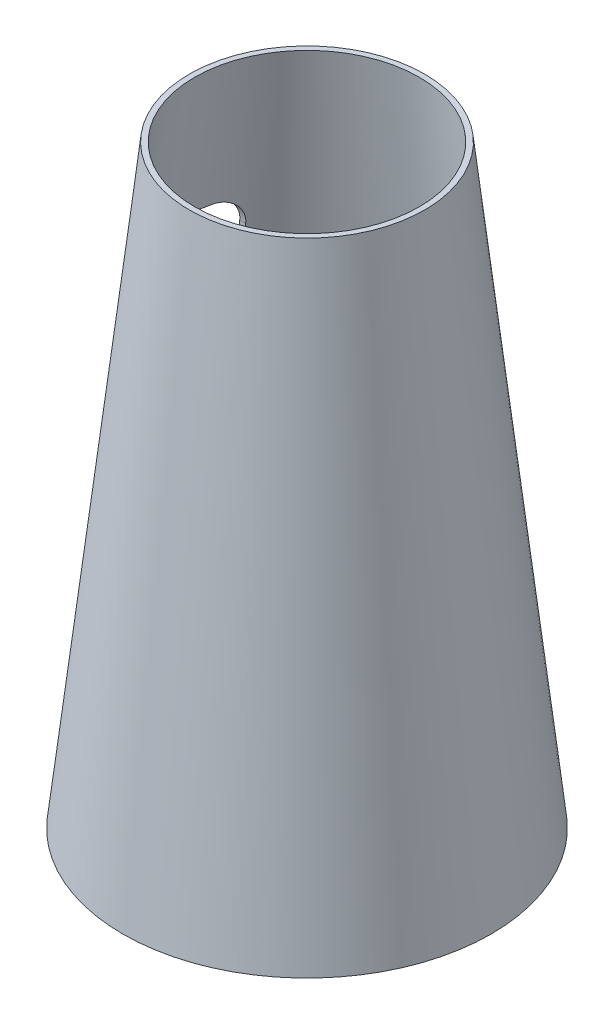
ISO-10303-21;
HEADER;
FILE_DESCRIPTION(('STEP AP214'),'2;1');
FILE_NAME('part.step','',(''),(''),'','','');
FILE_SCHEMA(('AUTOMOTIVE_DESIGN { 1 0 10303 214 1 1 1 1 }'));
ENDSEC;
DATA;
#1=APPLICATION_CONTEXT('core data for automotive mechanical design processes');
#2=APPLICATION_PROTOCOL_DEFINITION('international standard','automotive_design',2000,#1);
#3=PRODUCT_CONTEXT('',#1,'mechanical');
#4=PRODUCT('Part','Part','',(#3));
#5=PRODUCT_RELATED_PRODUCT_CATEGORY('part','',(#4));
#6=PRODUCT_DEFINITION_FORMATION('','',#4);
#7=PRODUCT_DEFINITION_CONTEXT('part definition',#1,'design');
#8=PRODUCT_DEFINITION('design','',#6,#7);
#9=PRODUCT_DEFINITION_SHAPE('','',#8);
#10=(LENGTH_UNIT() NAMED_UNIT(*) SI_UNIT(.MILLI.,.METRE.));
#11=(NAMED_UNIT(*) PLANE_ANGLE_UNIT() SI_UNIT($,.RADIAN.));
#12=(NAMED_UNIT(*) SI_UNIT($,.STERADIAN.) SOLID_ANGLE_UNIT());
#13=UNCERTAINTY_MEASURE_WITH_UNIT(LENGTH_MEASURE(1.E-05),#10,'distance_accuracy_value','');
#14=(GEOMETRIC_REPRESENTATION_CONTEXT(3) GLOBAL_UNCERTAINTY_ASSIGNED_CONTEXT((#13)) GLOBAL_UNIT_ASSIGNED_CONTEXT((#10,
#11,#12)) REPRESENTATION_CONTEXT('',''));
#15=CARTESIAN_POINT('',(0.,0.,0.));
#16=DIRECTION('',(0.,0.,1.));
#17=DIRECTION('',(1.,0.,0.));
#18=AXIS2_PLACEMENT_3D('',#15,#16,#17);
#19=CARTESIAN_POINT('',(0.,0.,0.));
#20=DIRECTION('',(0.,-1.,0.));
#21=DIRECTION('',(0.,0.,-1.));
#22=AXIS2_PLACEMENT_3D('',#19,#20,#21);
#23=CONICAL_SURFACE('',#22,66.2654821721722,0.111487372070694);
#24=CARTESIAN_POINT('',(0.,0.,0.));
#25=DIRECTION('',(0.,-1.,0.));
#26=DIRECTION('',(0.,0.,-1.));
#27=AXIS2_PLACEMENT_3D('',#24,#25,#26);
#28=CIRCLE('',#27,66.2654821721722);
#29=CARTESIAN_POINT('',(0.,0.,-66.2654821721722));
#30=VERTEX_POINT('',#29);
#31=EDGE_CURVE('E444',#30,#30,#28,.T.);
#32=ORIENTED_EDGE('',*,*,#31,.T.);
#33=EDGE_LOOP('',(#32));
#34=FACE_BOUND('',#33,.T.);
#35=CARTESIAN_POINT('',(0.,220.114554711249,0.));
#36=DIRECTION('',(0.,-1.,0.));
#37=DIRECTION('',(0.,0.,-1.));
#38=AXIS2_PLACEMENT_3D('',#35,#36,#37);
#39=CIRCLE('',#38,41.6233081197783);
#40=CARTESIAN_POINT('',(0.,220.114554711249,-41.6233081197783));
#41=VERTEX_POINT('',#40);
#42=EDGE_CURVE('E431',#41,#41,#39,.T.);
#43=ORIENTED_EDGE('',*,*,#42,.F.);
#44=EDGE_LOOP('',(#43));
#45=FACE_BOUND('',#44,.T.);
#46=CARTESIAN_POINT('',(0.,171.898730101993,0.));
#47=DIRECTION('',(0.,1.,0.));
#48=DIRECTION('',(0.,0.,1.));
#49=AXIS2_PLACEMENT_3D('',#46,#47,#48);
#50=CIRCLE('',#49,47.0211462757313);
#51=CARTESIAN_POINT('',(-45.782643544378,171.898730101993,10.7209023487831));
#52=VERTEX_POINT('',#51);
#53=CARTESIAN_POINT('',(-45.782643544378,171.898730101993,-10.7209023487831));
#54=VERTEX_POINT('',#53);
#55=EDGE_CURVE('E323',#52,#54,#50,.F.);
#56=ORIENTED_EDGE('',*,*,#55,.T.);
#57=CARTESIAN_POINT('',(-45.7826903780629,171.898730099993,-10.7207023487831));
#58=CARTESIAN_POINT('',(-45.7147127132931,171.89876087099,-11.011111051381));
#59=CARTESIAN_POINT('',(-45.6453055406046,171.886092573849,-11.3011663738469));
#60=CARTESIAN_POINT('',(-45.5042855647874,171.835718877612,-11.8785184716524));
#61=CARTESIAN_POINT('',(-45.432673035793,171.798016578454,-12.1658155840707));
#62=CARTESIAN_POINT('',(-45.2879064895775,171.697955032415,-12.735562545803));
#63=CARTESIAN_POINT('',(-45.2147530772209,171.635605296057,-13.0180142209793));
#64=CARTESIAN_POINT('',(-45.0676766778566,171.486757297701,-13.5762799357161));
#65=CARTESIAN_POINT('',(-44.9937536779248,171.400258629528,-13.8520938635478));
#66=CARTESIAN_POINT('',(-44.8460493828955,171.203716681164,-14.3952225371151));
#67=CARTESIAN_POINT('',(-44.772268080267,171.093674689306,-14.6625377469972));
#68=CARTESIAN_POINT('',(-44.6258344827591,170.850689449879,-15.1869942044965));
#69=CARTESIAN_POINT('',(-44.5531825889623,170.717738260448,-15.4441318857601));
#70=CARTESIAN_POINT('',(-44.4101595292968,170.429751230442,-15.9463653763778));
#71=CARTESIAN_POINT('',(-44.3397881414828,170.274717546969,-16.1914623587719));
#72=CARTESIAN_POINT('',(-44.2025279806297,169.943428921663,-16.667919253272));
#73=CARTESIAN_POINT('',(-44.1356392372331,169.767173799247,-16.899279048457));
#74=CARTESIAN_POINT('',(-44.00687425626,169.395137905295,-17.345702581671));
#75=CARTESIAN_POINT('',(-43.9449802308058,169.199432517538,-17.5608239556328));
#76=CARTESIAN_POINT('',(-43.8272815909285,168.789174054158,-17.9739351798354));
#77=CARTESIAN_POINT('',(-43.7714745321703,168.574628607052,-18.1719319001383));
#78=CARTESIAN_POINT('',(-43.667280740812,168.127987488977,-18.549170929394));
#79=CARTESIAN_POINT('',(-43.6188932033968,167.895893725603,-18.728415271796));
#80=CARTESIAN_POINT('',(-43.5308690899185,167.415732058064,-19.0664928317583));
#81=CARTESIAN_POINT('',(-43.4912317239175,167.167665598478,-19.2253278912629));
#82=CARTESIAN_POINT('',(-43.4240238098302,166.672625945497,-19.5121943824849));
#83=CARTESIAN_POINT('',(-43.3958751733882,166.426467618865,-19.641497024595));
#84=CARTESIAN_POINT('',(-43.3493493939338,165.923483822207,-19.8794363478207));
#85=CARTESIAN_POINT('',(-43.3309712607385,165.666659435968,-19.9880751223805));
#86=CARTESIAN_POINT('',(-43.3047481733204,165.144563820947,-20.1835754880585));
#87=CARTESIAN_POINT('',(-43.2968942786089,164.879299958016,-20.2704555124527));
#88=CARTESIAN_POINT('',(-43.2922114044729,164.342462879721,-20.4217242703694));
#89=CARTESIAN_POINT('',(-43.2953785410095,164.070891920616,-20.486120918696));
#90=CARTESIAN_POINT('',(-43.314293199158,163.483542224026,-20.5996849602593));
#91=CARTESIAN_POINT('',(-43.3318129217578,163.167106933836,-20.6452475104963));
#92=CARTESIAN_POINT('',(-43.3691259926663,162.691480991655,-20.6907036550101));
#93=CARTESIAN_POINT('',(-43.3833940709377,162.532845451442,-20.7020411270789));
#94=CARTESIAN_POINT('',(-43.4155416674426,162.215586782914,-20.7171420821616));
#95=CARTESIAN_POINT('',(-43.4334210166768,162.056963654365,-20.7209059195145));
#96=CARTESIAN_POINT('',(-43.4530748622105,161.898530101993,-20.7209023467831));
#97=B_SPLINE_CURVE_WITH_KNOTS('',3,(#57,#58,#59,#60,#61,#62,#63,#64,#65,#66,#67,#68,#69,#70,#71,
#72,#73,#74,#75,#76,#77,#78,#79,#80,#81,#82,#83,#84,#85,#86,#87,#88,#89,#90,#91,#92,#93,#94,#95,
#96),.UNSPECIFIED.,.F.,.F.,(4,2,2,2,2,2,2,2,2,2,2,2,2,2,2,2,2,2,2,4),(0.,0.894476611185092,
1.788842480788,2.68286358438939,3.57689972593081,4.47088695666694,5.36518472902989,
6.25939520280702,7.15361328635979,8.0444916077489,8.93501085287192,9.8254334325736,
10.7157755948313,11.5530892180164,12.390317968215,13.2268350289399,14.0630573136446,
15.0215815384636,15.5004308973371,15.9792578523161),.UNSPECIFIED.);
#98=CARTESIAN_POINT('',(-43.453050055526,161.898730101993,-20.7209023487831));
#99=VERTEX_POINT('',#98);
#100=EDGE_CURVE('E424',#54,#99,#97,.T.);
#101=ORIENTED_EDGE('',*,*,#100,.T.);
#102=CARTESIAN_POINT('',(-65.9231777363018,-25.3457131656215,-20.7209023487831));
#103=CARTESIAN_POINT('',(-64.9166133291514,-16.7685787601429,-20.7209023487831));
#104=CARTESIAN_POINT('',(-63.9080504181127,-8.19167846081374,-20.7209023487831));
#105=CARTESIAN_POINT('',(-61.8862073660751,8.96155749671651,-20.7209023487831));
#106=CARTESIAN_POINT('',(-60.8729272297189,17.5378931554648,-20.7209023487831));
#107=CARTESIAN_POINT('',(-58.8408938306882,34.69020471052,-20.7209023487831));
#108=CARTESIAN_POINT('',(-57.8221403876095,43.2661805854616,-20.7209023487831));
#109=CARTESIAN_POINT('',(-55.7782622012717,60.4173828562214,-20.7209023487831));
#110=CARTESIAN_POINT('',(-54.7531374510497,68.9926092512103,-20.7209023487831));
#111=CARTESIAN_POINT('',(-52.6953670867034,86.1421562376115,-20.7209023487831));
#112=CARTESIAN_POINT('',(-51.6627214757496,94.7164768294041,-20.7209023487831));
#113=CARTESIAN_POINT('',(-49.5884580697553,111.864005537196,-20.7209023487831));
#114=CARTESIAN_POINT('',(-48.5468403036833,120.437213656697,-20.7209023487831));
#115=CARTESIAN_POINT('',(-46.9762745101,133.295904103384,-20.7209023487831));
#116=CARTESIAN_POINT('',(-46.4514037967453,137.581884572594,-20.7209023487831));
#117=CARTESIAN_POINT('',(-45.3986486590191,146.153474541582,-20.7209023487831));
#118=CARTESIAN_POINT('',(-44.8707642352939,150.439084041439,-20.7209023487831));
#119=CARTESIAN_POINT('',(-43.8116455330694,159.009936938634,-20.7209023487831));
#120=CARTESIAN_POINT('',(-43.2804112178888,163.29518033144,-20.7209023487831));
#121=CARTESIAN_POINT('',(-42.2142083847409,171.865205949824,-20.7209023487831));
#122=CARTESIAN_POINT('',(-41.6792398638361,176.149988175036,-20.7209023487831));
#123=CARTESIAN_POINT('',(-40.2000389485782,187.950749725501,-20.7209023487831));
#124=CARTESIAN_POINT('',(-39.2514702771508,195.466186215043,-20.7209023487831));
#125=CARTESIAN_POINT('',(-37.3384709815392,210.495023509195,-20.7209023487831));
#126=CARTESIAN_POINT('',(-36.3740403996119,218.008424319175,-20.7209023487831));
#127=CARTESIAN_POINT('',(-34.9123399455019,229.276416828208,-20.7209023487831));
#128=CARTESIAN_POINT('',(-34.4226074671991,233.031986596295,-20.7209023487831));
#129=CARTESIAN_POINT('',(-33.4374205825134,240.542375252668,-20.7209023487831));
#130=CARTESIAN_POINT('',(-32.9419661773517,244.297194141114,-20.7209023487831));
#131=CARTESIAN_POINT('',(-31.9445194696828,251.806007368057,-20.7209023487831));
#132=CARTESIAN_POINT('',(-31.4425270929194,255.560001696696,-20.7209023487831));
#133=CARTESIAN_POINT('',(-30.4310168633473,263.066975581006,-20.7209023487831));
#134=CARTESIAN_POINT('',(-29.9214990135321,266.819955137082,-20.7209023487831));
#135=CARTESIAN_POINT('',(-28.8936225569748,274.325396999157,-20.7209023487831));
#136=CARTESIAN_POINT('',(-28.3752623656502,278.077859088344,-20.7209023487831));
#137=CARTESIAN_POINT('',(-27.328260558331,285.581345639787,-20.7209023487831));
#138=CARTESIAN_POINT('',(-26.7996189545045,289.332370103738,-20.7209023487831));
#139=CARTESIAN_POINT('',(-25.730120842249,296.832563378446,-20.7209023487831));
#140=CARTESIAN_POINT('',(-25.1892647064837,300.581732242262,-20.7209023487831));
#141=CARTESIAN_POINT('',(-24.0927761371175,308.077928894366,-20.7209023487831));
#142=CARTESIAN_POINT('',(-23.5371436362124,311.824956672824,-20.7209023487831));
#143=CARTESIAN_POINT('',(-22.4076390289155,319.31689802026,-20.7209023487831));
#144=CARTESIAN_POINT('',(-21.8337639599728,323.06181114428,-20.7209023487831));
#145=CARTESIAN_POINT('',(-20.955781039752,328.676473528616,-20.7209023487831));
#146=CARTESIAN_POINT('',(-20.6602599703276,330.547566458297,-20.7209023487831));
#147=CARTESIAN_POINT('',(-20.0627018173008,334.288710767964,-20.7209023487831));
#148=CARTESIAN_POINT('',(-19.7606647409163,336.158762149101,-20.7209023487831));
#149=CARTESIAN_POINT('',(-19.1491156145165,339.897845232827,-20.7209023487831));
#150=CARTESIAN_POINT('',(-18.8396027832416,341.766876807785,-20.7209023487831));
#151=CARTESIAN_POINT('',(-18.211981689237,345.503491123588,-20.7209023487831));
#152=CARTESIAN_POINT('',(-17.8938734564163,347.371073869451,-20.7209023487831));
#153=CARTESIAN_POINT('',(-17.2476104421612,351.104586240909,-20.7209023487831));
#154=CARTESIAN_POINT('',(-16.9194552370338,352.970515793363,-20.7209023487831));
#155=CARTESIAN_POINT('',(-16.4183062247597,355.767823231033,-20.7209023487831));
#156=CARTESIAN_POINT('',(-16.2497694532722,356.700000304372,-20.7209023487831));
#157=CARTESIAN_POINT('',(-15.9094286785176,358.563759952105,-20.7209023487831));
#158=CARTESIAN_POINT('',(-15.7376246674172,359.495342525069,-20.7209023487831));
#159=CARTESIAN_POINT('',(-15.5640395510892,360.426594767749,-20.7209023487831));
#160=B_SPLINE_CURVE_WITH_KNOTS('',3,(#102,#103,#104,#105,#106,#107,#108,#109,#110,#111,#112,
#113,#114,#115,#116,#117,#118,#119,#120,#121,#122,#123,#124,#125,#126,#127,#128,#129,#130,#131,
#132,#133,#134,#135,#136,#137,#138,#139,#140,#141,#142,#143,#144,#145,#146,#147,#148,#149,#150,
#151,#152,#153,#154,#155,#156,#157,#158,#159),.UNSPECIFIED.,.F.,.F.,(4,2,2,2,2,2,2,2,2,2,2,2,2,
2,2,2,2,2,2,2,2,2,2,2,2,2,2,2,4),(0.,25.9079848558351,51.8159442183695,77.7247628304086,
103.633609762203,129.542445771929,155.451198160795,168.405195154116,181.359189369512,
194.313325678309,207.267472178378,229.992645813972,252.717758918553,264.079853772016,
275.441946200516,286.804167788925,298.166384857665,309.530659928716,320.894921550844,
332.258836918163,343.622804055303,354.988626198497,360.671476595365,366.354320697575,
372.037761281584,377.721182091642,383.404842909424,386.246708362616,389.088580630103),.UNSPECIFIED.);
#161=CARTESIAN_POINT('',(-55.2340681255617,64.9621649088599,-20.7209023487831));
#162=VERTEX_POINT('',#161);
#163=EDGE_CURVE('E432',#99,#162,#160,.F.);
#164=ORIENTED_EDGE('',*,*,#163,.T.);
#165=CARTESIAN_POINT('',(-55.2340442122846,64.96236490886,-20.7209023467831));
#166=CARTESIAN_POINT('',(-55.2674627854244,64.6826052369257,-20.7209447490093));
#167=CARTESIAN_POINT('',(-55.3052733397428,64.4034125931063,-20.709175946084));
#168=CARTESIAN_POINT('',(-55.3890457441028,63.8483095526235,-20.6625656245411));
#169=CARTESIAN_POINT('',(-55.4350041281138,63.5723978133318,-20.6277338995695));
#170=CARTESIAN_POINT('',(-55.5342997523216,63.0266936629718,-20.5357033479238));
#171=CARTESIAN_POINT('',(-55.5876113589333,62.7568836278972,-20.4785810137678));
#172=CARTESIAN_POINT('',(-55.7009713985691,62.2242017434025,-20.3427059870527));
#173=CARTESIAN_POINT('',(-55.7610204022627,61.9613304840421,-20.2639514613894));
#174=CARTESIAN_POINT('',(-55.886914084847,61.4446018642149,-20.0858011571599));
#175=CARTESIAN_POINT('',(-55.9527496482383,61.1907311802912,-19.9864375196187));
#176=CARTESIAN_POINT('',(-56.0894255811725,60.6929664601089,-19.7678829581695));
#177=CARTESIAN_POINT('',(-56.160267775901,60.4490761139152,-19.648684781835));
#178=CARTESIAN_POINT('',(-56.3060469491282,59.9725832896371,-19.3913941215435));
#179=CARTESIAN_POINT('',(-56.380986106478,59.7399869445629,-19.2532915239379));
#180=CARTESIAN_POINT('',(-56.53398468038,59.2874324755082,-18.9592419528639));
#181=CARTESIAN_POINT('',(-56.612044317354,59.0674752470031,-18.8032937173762));
#182=CARTESIAN_POINT('',(-56.77446981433,58.630212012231,-18.4659999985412));
#183=CARTESIAN_POINT('',(-56.8589521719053,58.4136435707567,-18.2837537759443));
#184=CARTESIAN_POINT('',(-57.0292328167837,57.9969896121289,-17.9018632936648));
#185=CARTESIAN_POINT('',(-57.1150311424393,57.7969045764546,-17.7022185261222));
#186=CARTESIAN_POINT('',(-57.2869029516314,57.4143155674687,-17.2867040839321));
#187=CARTESIAN_POINT('',(-57.3729765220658,57.2318178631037,-17.0708286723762));
#188=CARTESIAN_POINT('',(-57.544319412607,56.8856092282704,-16.6242134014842));
#189=CARTESIAN_POINT('',(-57.629588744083,56.7218980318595,-16.3934737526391));
#190=CARTESIAN_POINT('',(-57.801612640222,56.4083226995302,-15.9091790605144));
#191=CARTESIAN_POINT('',(-57.8882948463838,56.2592506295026,-15.6550846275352));
#192=CARTESIAN_POINT('',(-58.0585661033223,55.9837923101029,-15.1340241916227));
#193=CARTESIAN_POINT('',(-58.1421562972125,55.8573976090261,-14.8670630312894));
#194=CARTESIAN_POINT('',(-58.3051714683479,55.6284453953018,-14.3221414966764));
#195=CARTESIAN_POINT('',(-58.3845998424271,55.5258682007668,-14.0441904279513));
#196=CARTESIAN_POINT('',(-58.5383590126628,55.3455034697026,-13.4791260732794));
#197=CARTESIAN_POINT('',(-58.6126914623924,55.2677078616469,-13.1920158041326));
#198=CARTESIAN_POINT('',(-58.7713250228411,55.1233288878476,-12.5456949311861));
#199=CARTESIAN_POINT('',(-58.8541608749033,55.0630982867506,-12.1846638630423));
#200=CARTESIAN_POINT('',(-58.970624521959,55.0026609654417,-11.638448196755));
#201=CARTESIAN_POINT('',(-59.0081436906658,54.9874999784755,-11.4556184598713));
#202=CARTESIAN_POINT('',(-59.0804700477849,54.9672503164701,-11.0888619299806));
#203=CARTESIAN_POINT('',(-59.115277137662,54.9621620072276,-10.904935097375));
#204=CARTESIAN_POINT('',(-59.1486671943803,54.9621649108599,-10.720702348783));
#205=B_SPLINE_CURVE_WITH_KNOTS('',3,(#165,#166,#167,#168,#169,#170,#171,#172,#173,#174,#175,
#176,#177,#178,#179,#180,#181,#182,#183,#184,#185,#186,#187,#188,#189,#190,#191,#192,#193,#194,
#195,#196,#197,#198,#199,#200,#201,#202,#203,#204),.UNSPECIFIED.,.F.,.F.,(4,2,2,2,2,2,2,2,2,2,2,
2,2,2,2,2,2,2,2,4),(0.,0.844903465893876,1.68944837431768,2.53112027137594,3.37286351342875,
4.21330375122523,5.05405197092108,5.89525175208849,6.7365110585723,7.62167827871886,
8.50687134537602,9.39237877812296,10.2778736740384,11.1980034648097,12.1177896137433,
13.036812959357,13.9555366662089,15.0788101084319,15.6403235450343,16.2018573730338),.UNSPECIFIED.);
#206=CARTESIAN_POINT('',(-59.1486309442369,54.9621649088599,-10.7209023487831));
#207=VERTEX_POINT('',#206);
#208=EDGE_CURVE('E466',#162,#207,#205,.T.);
#209=ORIENTED_EDGE('',*,*,#208,.T.);
#210=CARTESIAN_POINT('',(0.,54.9621649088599,0.));
#211=DIRECTION('',(0.,-1.,0.));
#212=DIRECTION('',(0.,0.,-1.));
#213=AXIS2_PLACEMENT_3D('',#210,#211,#212);
#214=CIRCLE('',#213,60.1123805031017);
#215=CARTESIAN_POINT('',(-59.1486309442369,54.9621649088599,10.7209023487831));
#216=VERTEX_POINT('',#215);
#217=EDGE_CURVE('E465',#207,#216,#214,.F.);
#218=ORIENTED_EDGE('',*,*,#217,.T.);
#219=CARTESIAN_POINT('',(-59.1486671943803,54.9621649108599,10.720702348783));
#220=CARTESIAN_POINT('',(-59.096657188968,54.9621267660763,11.0077963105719));
#221=CARTESIAN_POINT('',(-59.0411543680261,54.9745147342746,11.2942174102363));
#222=CARTESIAN_POINT('',(-58.9237791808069,55.0235647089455,11.8635552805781));
#223=CARTESIAN_POINT('',(-58.8619090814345,55.0602181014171,12.1464732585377));
#224=CARTESIAN_POINT('',(-58.7325496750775,55.1570927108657,12.7061087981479));
#225=CARTESIAN_POINT('',(-58.6650757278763,55.2172510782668,12.9828408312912));
#226=CARTESIAN_POINT('',(-58.5250786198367,55.3603913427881,13.5290414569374));
#227=CARTESIAN_POINT('',(-58.4525551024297,55.4433748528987,13.798509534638));
#228=CARTESIAN_POINT('',(-58.3033409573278,55.6312037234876,14.3281196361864));
#229=CARTESIAN_POINT('',(-58.2266554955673,55.7360224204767,14.5882725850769));
#230=CARTESIAN_POINT('',(-58.0698580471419,55.9667034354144,15.0981151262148));
#231=CARTESIAN_POINT('',(-57.9897448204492,56.0925734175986,15.3478008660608));
#232=CARTESIAN_POINT('',(-57.8269881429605,56.3644079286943,15.8352428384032));
#233=CARTESIAN_POINT('',(-57.7443437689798,56.5103798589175,16.0729946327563));
#234=CARTESIAN_POINT('',(-57.5774921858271,56.8213772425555,16.5351223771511));
#235=CARTESIAN_POINT('',(-57.493284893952,56.9864037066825,16.7594976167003));
#236=CARTESIAN_POINT('',(-57.3209139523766,57.3414105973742,17.202244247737));
#237=CARTESIAN_POINT('',(-57.2327264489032,57.5321237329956,17.4200193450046));
#238=CARTESIAN_POINT('',(-57.0568491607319,57.9318140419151,17.8383356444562));
#239=CARTESIAN_POINT('',(-56.9691593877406,58.1407916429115,18.0388764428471));
#240=CARTESIAN_POINT('',(-56.7954004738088,58.5758310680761,18.4214658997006));
#241=CARTESIAN_POINT('',(-56.7093319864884,58.8018996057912,18.6035072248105));
#242=CARTESIAN_POINT('',(-56.5400330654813,59.2696929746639,18.947692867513));
#243=CARTESIAN_POINT('',(-56.4568024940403,59.5114170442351,19.1098381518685));
#244=CARTESIAN_POINT('',(-56.2934670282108,60.0118216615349,19.4146277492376));
#245=CARTESIAN_POINT('',(-56.2134065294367,60.2706593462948,19.5570382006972));
#246=CARTESIAN_POINT('',(-56.0586457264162,60.8011078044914,19.8188718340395));
#247=CARTESIAN_POINT('',(-55.9839431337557,61.0727130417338,19.9383048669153));
#248=CARTESIAN_POINT('',(-55.8411344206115,61.626634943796,20.1528868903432));
#249=CARTESIAN_POINT('',(-55.7730201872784,61.9089378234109,20.2480659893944));
#250=CARTESIAN_POINT('',(-55.6444322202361,62.4823894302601,20.4131529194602));
#251=CARTESIAN_POINT('',(-55.5839552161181,62.7735343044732,20.4830715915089));
#252=CARTESIAN_POINT('',(-55.4685958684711,63.3784165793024,20.5997465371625));
#253=CARTESIAN_POINT('',(-55.4141875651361,63.6925281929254,20.6450593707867));
#254=CARTESIAN_POINT('',(-55.3405349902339,64.1668661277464,20.6904937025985));
#255=CARTESIAN_POINT('',(-55.3173144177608,64.3254768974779,20.7018826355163));
#256=CARTESIAN_POINT('',(-55.2736068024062,64.6434468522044,20.7170890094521));
#257=CARTESIAN_POINT('',(-55.2531199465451,64.8028060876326,20.7209059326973));
#258=CARTESIAN_POINT('',(-55.2340442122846,64.96236490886,20.7209023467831));
#259=B_SPLINE_CURVE_WITH_KNOTS('',3,(#219,#220,#221,#222,#223,#224,#225,#226,#227,#228,#229,
#230,#231,#232,#233,#234,#235,#236,#237,#238,#239,#240,#241,#242,#243,#244,#245,#246,#247,#248,
#249,#250,#251,#252,#253,#254,#255,#256,#257,#258),.UNSPECIFIED.,.F.,.F.,(4,2,2,2,2,2,2,2,2,2,2,
2,2,2,2,2,2,2,2,4),(0.,0.87495861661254,1.74960679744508,2.6219321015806,3.49431906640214,
4.36564691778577,5.23729269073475,6.10926025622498,6.9812740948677,7.88806425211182,
8.79487564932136,9.70204512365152,10.6091705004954,11.5262636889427,12.4429628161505,
13.358518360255,14.2736805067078,15.2379270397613,15.7198680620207,16.201842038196),.UNSPECIFIED.);
#260=CARTESIAN_POINT('',(-55.2340681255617,64.9621649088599,20.7209023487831));
#261=VERTEX_POINT('',#260);
#262=EDGE_CURVE('E464',#216,#261,#259,.T.);
#263=ORIENTED_EDGE('',*,*,#262,.T.);
#264=CARTESIAN_POINT('',(-65.9231777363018,-25.3457131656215,20.7209023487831));
#265=CARTESIAN_POINT('',(-64.9166133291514,-16.7685787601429,20.7209023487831));
#266=CARTESIAN_POINT('',(-63.9080504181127,-8.19167846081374,20.7209023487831));
#267=CARTESIAN_POINT('',(-61.8862073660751,8.96155749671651,20.7209023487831));
#268=CARTESIAN_POINT('',(-60.8729272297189,17.5378931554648,20.7209023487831));
#269=CARTESIAN_POINT('',(-58.8408938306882,34.69020471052,20.7209023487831));
#270=CARTESIAN_POINT('',(-57.8221403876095,43.2661805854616,20.7209023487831));
#271=CARTESIAN_POINT('',(-55.7782622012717,60.4173828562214,20.7209023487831));
#272=CARTESIAN_POINT('',(-54.7531374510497,68.9926092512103,20.7209023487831));
#273=CARTESIAN_POINT('',(-52.6953670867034,86.1421562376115,20.7209023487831));
#274=CARTESIAN_POINT('',(-51.6627214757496,94.7164768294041,20.7209023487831));
#275=CARTESIAN_POINT('',(-49.5884580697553,111.864005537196,20.7209023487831));
#276=CARTESIAN_POINT('',(-48.5468403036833,120.437213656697,20.7209023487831));
#277=CARTESIAN_POINT('',(-46.9762745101,133.295904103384,20.7209023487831));
#278=CARTESIAN_POINT('',(-46.4514037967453,137.581884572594,20.7209023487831));
#279=CARTESIAN_POINT('',(-45.3986486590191,146.153474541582,20.7209023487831));
#280=CARTESIAN_POINT('',(-44.8707642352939,150.439084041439,20.7209023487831));
#281=CARTESIAN_POINT('',(-43.8116455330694,159.009936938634,20.7209023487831));
#282=CARTESIAN_POINT('',(-43.2804112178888,163.29518033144,20.7209023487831));
#283=CARTESIAN_POINT('',(-42.2142083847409,171.865205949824,20.7209023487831));
#284=CARTESIAN_POINT('',(-41.6792398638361,176.149988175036,20.7209023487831));
#285=CARTESIAN_POINT('',(-40.2000389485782,187.950749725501,20.7209023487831));
#286=CARTESIAN_POINT('',(-39.2514702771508,195.466186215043,20.7209023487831));
#287=CARTESIAN_POINT('',(-37.3384709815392,210.495023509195,20.7209023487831));
#288=CARTESIAN_POINT('',(-36.3740403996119,218.008424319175,20.7209023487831));
#289=CARTESIAN_POINT('',(-34.9123399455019,229.276416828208,20.7209023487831));
#290=CARTESIAN_POINT('',(-34.4226074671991,233.031986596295,20.7209023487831));
#291=CARTESIAN_POINT('',(-33.4374205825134,240.542375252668,20.7209023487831));
#292=CARTESIAN_POINT('',(-32.9419661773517,244.297194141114,20.7209023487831));
#293=CARTESIAN_POINT('',(-31.9445194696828,251.806007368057,20.7209023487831));
#294=CARTESIAN_POINT('',(-31.4425270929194,255.560001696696,20.7209023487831));
#295=CARTESIAN_POINT('',(-30.4310168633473,263.066975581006,20.7209023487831));
#296=CARTESIAN_POINT('',(-29.9214990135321,266.819955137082,20.7209023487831));
#297=CARTESIAN_POINT('',(-28.8936225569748,274.325396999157,20.7209023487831));
#298=CARTESIAN_POINT('',(-28.3752623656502,278.077859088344,20.7209023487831));
#299=CARTESIAN_POINT('',(-27.328260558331,285.581345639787,20.7209023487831));
#300=CARTESIAN_POINT('',(-26.7996189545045,289.332370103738,20.7209023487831));
#301=CARTESIAN_POINT('',(-25.730120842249,296.832563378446,20.7209023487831));
#302=CARTESIAN_POINT('',(-25.1892647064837,300.581732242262,20.7209023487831));
#303=CARTESIAN_POINT('',(-24.0927761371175,308.077928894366,20.7209023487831));
#304=CARTESIAN_POINT('',(-23.5371436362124,311.824956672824,20.7209023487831));
#305=CARTESIAN_POINT('',(-22.4076390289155,319.31689802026,20.7209023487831));
#306=CARTESIAN_POINT('',(-21.8337639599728,323.06181114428,20.7209023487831));
#307=CARTESIAN_POINT('',(-20.955781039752,328.676473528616,20.7209023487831));
#308=CARTESIAN_POINT('',(-20.6602599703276,330.547566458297,20.7209023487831));
#309=CARTESIAN_POINT('',(-20.0627018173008,334.288710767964,20.7209023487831));
#310=CARTESIAN_POINT('',(-19.7606647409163,336.158762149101,20.7209023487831));
#311=CARTESIAN_POINT('',(-19.1491156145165,339.897845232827,20.7209023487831));
#312=CARTESIAN_POINT('',(-18.8396027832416,341.766876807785,20.7209023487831));
#313=CARTESIAN_POINT('',(-18.211981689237,345.503491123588,20.7209023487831));
#314=CARTESIAN_POINT('',(-17.8938734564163,347.371073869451,20.7209023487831));
#315=CARTESIAN_POINT('',(-17.2476104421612,351.104586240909,20.7209023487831));
#316=CARTESIAN_POINT('',(-16.9194552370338,352.970515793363,20.7209023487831));
#317=CARTESIAN_POINT('',(-16.4183062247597,355.767823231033,20.7209023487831));
#318=CARTESIAN_POINT('',(-16.2497694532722,356.700000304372,20.7209023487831));
#319=CARTESIAN_POINT('',(-15.9094286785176,358.563759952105,20.7209023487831));
#320=CARTESIAN_POINT('',(-15.7376246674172,359.495342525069,20.7209023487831));
#321=CARTESIAN_POINT('',(-15.5640395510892,360.426594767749,20.7209023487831));
#322=B_SPLINE_CURVE_WITH_KNOTS('',3,(#264,#265,#266,#267,#268,#269,#270,#271,#272,#273,#274,
#275,#276,#277,#278,#279,#280,#281,#282,#283,#284,#285,#286,#287,#288,#289,#290,#291,#292,#293,
#294,#295,#296,#297,#298,#299,#300,#301,#302,#303,#304,#305,#306,#307,#308,#309,#310,#311,#312,
#313,#314,#315,#316,#317,#318,#319,#320,#321),.UNSPECIFIED.,.F.,.F.,(4,2,2,2,2,2,2,2,2,2,2,2,2,
2,2,2,2,2,2,2,2,2,2,2,2,2,2,2,4),(0.,25.9079848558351,51.8159442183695,77.7247628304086,
103.633609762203,129.542445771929,155.451198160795,168.405195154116,181.359189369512,
194.313325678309,207.267472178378,229.992645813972,252.717758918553,264.079853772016,
275.441946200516,286.804167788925,298.166384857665,309.530659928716,320.894921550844,
332.258836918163,343.622804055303,354.988626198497,360.671476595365,366.354320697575,
372.037761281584,377.721182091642,383.404842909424,386.246708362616,389.088580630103),.UNSPECIFIED.);
#323=CARTESIAN_POINT('',(-43.453050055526,161.898730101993,20.7209023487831));
#324=VERTEX_POINT('',#323);
#325=EDGE_CURVE('E354',#261,#324,#322,.T.);
#326=ORIENTED_EDGE('',*,*,#325,.T.);
#327=CARTESIAN_POINT('',(-43.4530748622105,161.898530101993,20.7209023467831));
#328=CARTESIAN_POINT('',(-43.421391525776,162.153664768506,20.7209473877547));
#329=CARTESIAN_POINT('',(-43.3943570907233,162.409389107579,20.7111498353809));
#330=CARTESIAN_POINT('',(-43.3497445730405,162.920139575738,20.6718876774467));
#331=CARTESIAN_POINT('',(-43.3321660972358,163.175165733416,20.6424238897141));
#332=CARTESIAN_POINT('',(-43.3066559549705,163.681977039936,20.5639537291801));
#333=CARTESIAN_POINT('',(-43.298698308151,163.933769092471,20.5150004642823));
#334=CARTESIAN_POINT('',(-43.2922396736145,164.432948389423,20.3978567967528));
#335=CARTESIAN_POINT('',(-43.2937383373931,164.680335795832,20.3296671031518));
#336=CARTESIAN_POINT('',(-43.3059045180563,165.169037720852,20.1745179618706));
#337=CARTESIAN_POINT('',(-43.316576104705,165.410349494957,20.0875501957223));
#338=CARTESIAN_POINT('',(-43.3466197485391,165.8851246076,19.8955540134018));
#339=CARTESIAN_POINT('',(-43.3659922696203,166.118587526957,19.7905246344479));
#340=CARTESIAN_POINT('',(-43.4128187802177,166.576171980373,19.5632331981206));
#341=CARTESIAN_POINT('',(-43.4402743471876,166.800291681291,19.4409677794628));
#342=CARTESIAN_POINT('',(-43.5025271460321,167.2377840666,19.1801789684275));
#343=CARTESIAN_POINT('',(-43.5373244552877,167.451156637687,19.0416554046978));
#344=CARTESIAN_POINT('',(-43.61420122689,167.870081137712,18.7464814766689));
#345=CARTESIAN_POINT('',(-43.6564114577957,168.075393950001,18.5895260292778));
#346=CARTESIAN_POINT('',(-43.7467241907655,168.472574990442,18.2608648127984));
#347=CARTESIAN_POINT('',(-43.7948286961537,168.664438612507,18.089154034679));
#348=CARTESIAN_POINT('',(-43.8960002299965,169.03373190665,17.7321587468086));
#349=CARTESIAN_POINT('',(-43.9490680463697,169.211159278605,17.5468720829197));
#350=CARTESIAN_POINT('',(-44.0592444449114,169.55073525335,17.1639079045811));
#351=CARTESIAN_POINT('',(-44.1163532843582,169.712882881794,16.9662296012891));
#352=CARTESIAN_POINT('',(-44.2382675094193,170.033117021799,16.5439002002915));
#353=CARTESIAN_POINT('',(-44.303326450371,170.189917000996,16.3183457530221));
#354=CARTESIAN_POINT('',(-44.436015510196,170.48408872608,15.8557565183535));
#355=CARTESIAN_POINT('',(-44.5036447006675,170.621467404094,15.6187258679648));
#356=CARTESIAN_POINT('',(-44.6405406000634,170.876227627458,15.1344529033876));
#357=CARTESIAN_POINT('',(-44.7098080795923,170.99359954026,14.8872057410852));
#358=CARTESIAN_POINT('',(-44.8490100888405,171.207599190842,14.3841844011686));
#359=CARTESIAN_POINT('',(-44.9189443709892,171.30423433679,14.1284133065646));
#360=CARTESIAN_POINT('',(-45.0569337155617,171.474113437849,13.6162441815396));
#361=CARTESIAN_POINT('',(-45.1249922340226,171.547879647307,13.3600201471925));
#362=CARTESIAN_POINT('',(-45.2602884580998,171.674756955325,12.8423015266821));
#363=CARTESIAN_POINT('',(-45.3275261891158,171.727868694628,12.5808071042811));
#364=CARTESIAN_POINT('',(-45.4605782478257,171.813059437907,12.0540328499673));
#365=CARTESIAN_POINT('',(-45.5263924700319,171.845136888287,11.7887527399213));
#366=CARTESIAN_POINT('',(-45.656104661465,171.887985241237,11.255981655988));
#367=CARTESIAN_POINT('',(-45.7200024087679,171.898753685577,10.9884904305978));
#368=CARTESIAN_POINT('',(-45.7826903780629,171.898730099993,10.7207023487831));
#369=B_SPLINE_CURVE_WITH_KNOTS('',3,(#327,#328,#329,#330,#331,#332,#333,#334,#335,#336,#337,
#338,#339,#340,#341,#342,#343,#344,#345,#346,#347,#348,#349,#350,#351,#352,#353,#354,#355,#356,
#357,#358,#359,#360,#361,#362,#363,#364,#365,#366,#367,#368),.UNSPECIFIED.,.F.,.F.,(4,2,2,2,2,2,
2,2,2,2,2,2,2,2,2,2,2,2,2,2,4),(0.,0.771071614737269,1.54211116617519,2.31106389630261,
3.07998828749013,3.84925400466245,4.61856074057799,5.38801771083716,6.15748279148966,
6.94221246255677,7.72720958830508,8.51233154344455,9.29750352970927,10.1434697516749,
10.9891332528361,11.8352027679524,12.6809695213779,13.505689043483,14.3303829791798,
15.1551378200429,15.9799877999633),.UNSPECIFIED.);
#370=EDGE_CURVE('E347',#324,#52,#369,.T.);
#371=ORIENTED_EDGE('',*,*,#370,.T.);
#372=EDGE_LOOP('',(#56,#101,#164,#209,#218,#263,#326,#371));
#373=FACE_BOUND('',#372,.T.);
#374=CARTESIAN_POINT('',(53.5080180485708,58.5370789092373,-26.5034797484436));
#375=CARTESIAN_POINT('',(53.6805090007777,57.1564018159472,-26.5034797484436));
#376=CARTESIAN_POINT('',(53.9898412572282,55.8242858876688,-26.21844216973));
#377=CARTESIAN_POINT('',(54.7796735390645,53.3980942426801,-25.1827986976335));
#378=CARTESIAN_POINT('',(55.2582852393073,52.3089926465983,-24.4312074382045));
#379=CARTESIAN_POINT('',(56.7397590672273,49.6153408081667,-21.6952317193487));
#380=CARTESIAN_POINT('',(57.79628713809,48.5370789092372,-19.178247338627));
#381=CARTESIAN_POINT('',(58.550220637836,48.5370789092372,-16.5034797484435));
#382=B_SPLINE_CURVE_WITH_KNOTS('',3,(#374,#375,#376,#377,#378,#379,#380,#381),.UNSPECIFIED.,.F.,
.F.,(4,2,2,4),(0.,0.25,0.5,1.),.UNSPECIFIED.);
#383=CARTESIAN_POINT('',(53.5080180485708,58.5370789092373,-26.5034797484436));
#384=VERTEX_POINT('',#383);
#385=CARTESIAN_POINT('',(58.550220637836,48.5370789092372,-16.5034797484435));
#386=VERTEX_POINT('',#385);
#387=EDGE_CURVE('E1100',#384,#386,#382,.T.);
#388=ORIENTED_EDGE('',*,*,#387,.F.);
#389=CARTESIAN_POINT('',(53.5080180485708,58.5370789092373,-26.5034797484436));
#390=CARTESIAN_POINT('',(52.9083875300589,63.3366144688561,-26.5034856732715));
#391=CARTESIAN_POINT('',(52.3068170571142,68.135908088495,-26.5035046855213));
#392=CARTESIAN_POINT('',(51.1180094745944,77.5855440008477,-26.5035389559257));
#393=CARTESIAN_POINT('',(50.5309044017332,82.2359029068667,-26.503554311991));
#394=CARTESIAN_POINT('',(49.3710116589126,91.3876705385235,-26.5035552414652));
#395=CARTESIAN_POINT('',(48.7983649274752,95.8890971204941,-26.5035417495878));
#396=CARTESIAN_POINT('',(47.667340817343,104.742998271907,-26.5035025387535));
#397=CARTESIAN_POINT('',(47.1091152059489,109.09549222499,-26.503477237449));
#398=CARTESIAN_POINT('',(45.9249595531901,118.287344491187,-26.5034825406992));
#399=CARTESIAN_POINT('',(45.2984496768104,123.126628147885,-26.5035197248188));
#400=CARTESIAN_POINT('',(44.0616168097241,132.627662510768,-26.5035822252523));
#401=CARTESIAN_POINT('',(43.4515378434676,137.289444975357,-26.5036079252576));
#402=CARTESIAN_POINT('',(42.2475067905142,146.435476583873,-26.5036056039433));
#403=CARTESIAN_POINT('',(41.6538193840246,150.91976054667,-26.5035795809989));
#404=CARTESIAN_POINT('',(40.4824203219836,159.710784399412,-26.5035231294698));
#405=CARTESIAN_POINT('',(39.9049999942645,164.017563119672,-26.5034929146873));
#406=CARTESIAN_POINT('',(39.3236733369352,168.323816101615,-26.5034797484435));
#407=B_SPLINE_CURVE_WITH_KNOTS('',3,(#389,#390,#391,#392,#393,#394,#395,#396,#397,#398,#399,
#400,#401,#402,#403,#404,#405,#406),.UNSPECIFIED.,.F.,.F.,(4,2,2,2,2,2,2,2,4),(0.,
14.51054414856,28.5723619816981,42.1854743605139,55.3499079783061,69.988914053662,
84.0935082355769,97.6637418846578,110.699680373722),.UNSPECIFIED.);
#408=CARTESIAN_POINT('',(39.3236733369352,168.323816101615,-26.5034797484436));
#409=VERTEX_POINT('',#408);
#410=EDGE_CURVE('E1055',#384,#409,#407,.T.);
#411=ORIENTED_EDGE('',*,*,#410,.T.);
#412=CARTESIAN_POINT('',(43.2607935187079,178.323816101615,-16.5034797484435));
#413=CARTESIAN_POINT('',(42.7693569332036,178.323816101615,-17.7916890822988));
#414=CARTESIAN_POINT('',(42.2574767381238,178.081640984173,-19.0352452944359));
#415=CARTESIAN_POINT('',(41.2288154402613,177.13443413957,-21.4022543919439));
#416=CARTESIAN_POINT('',(40.7308363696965,176.444869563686,-22.4820251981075));
#417=CARTESIAN_POINT('',(40.0863816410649,175.093969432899,-23.8918931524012));
#418=CARTESIAN_POINT('',(39.8939935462,174.60054581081,-24.316035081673));
#419=CARTESIAN_POINT('',(39.5666208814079,173.522219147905,-25.0714411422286));
#420=CARTESIAN_POINT('',(39.4303310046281,172.92725851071,-25.4066607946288));
#421=CARTESIAN_POINT('',(39.1514542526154,171.064294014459,-26.2154846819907));
#422=CARTESIAN_POINT('',(39.1384764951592,169.695592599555,-26.5034797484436));
#423=CARTESIAN_POINT('',(39.3236733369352,168.323816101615,-26.5034797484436));
#424=B_SPLINE_CURVE_WITH_KNOTS('',3,(#412,#413,#414,#415,#416,#417,#418,#419,#420,#421,#422,
#423),.UNSPECIFIED.,.F.,.F.,(4,2,2,2,2,4),(0.,0.250000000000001,0.500000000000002,0.625,
0.749999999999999,1.),.UNSPECIFIED.);
#425=CARTESIAN_POINT('',(43.2607935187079,178.323816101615,-16.5034797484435));
#426=VERTEX_POINT('',#425);
#427=EDGE_CURVE('E955',#426,#409,#424,.T.);
#428=ORIENTED_EDGE('',*,*,#427,.F.);
#429=CARTESIAN_POINT('',(0.,178.323816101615,0.));
#430=DIRECTION('',(0.,-1.,0.));
#431=DIRECTION('',(0.,0.,-1.));
#432=AXIS2_PLACEMENT_3D('',#429,#430,#431);
#433=CIRCLE('',#432,46.3018476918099);
#434=CARTESIAN_POINT('',(43.2607935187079,178.323816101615,16.5034797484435));
#435=VERTEX_POINT('',#434);
#436=EDGE_CURVE('E641',#426,#435,#433,.T.);
#437=ORIENTED_EDGE('',*,*,#436,.T.);
#438=CARTESIAN_POINT('',(39.3236733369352,168.323816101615,26.5034797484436));
#439=CARTESIAN_POINT('',(39.2313835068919,169.007418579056,26.5034797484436));
#440=CARTESIAN_POINT('',(39.1871178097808,169.682858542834,26.4341092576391));
#441=CARTESIAN_POINT('',(39.1924967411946,171.017519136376,26.1579275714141));
#442=CARTESIAN_POINT('',(39.2439215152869,171.679280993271,25.947819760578));
#443=CARTESIAN_POINT('',(39.5205930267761,173.535610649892,25.1438506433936));
#444=CARTESIAN_POINT('',(39.8714412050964,174.643022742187,24.3621310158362));
#445=CARTESIAN_POINT('',(40.7295795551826,176.442624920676,22.4847601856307));
#446=CARTESIAN_POINT('',(41.230920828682,177.136740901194,21.3975063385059));
#447=CARTESIAN_POINT('',(42.2577689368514,178.081541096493,19.0344761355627));
#448=CARTESIAN_POINT('',(42.770204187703,178.323816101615,17.78946816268));
#449=CARTESIAN_POINT('',(43.2607935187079,178.323816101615,16.5034797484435));
#450=B_SPLINE_CURVE_WITH_KNOTS('',3,(#438,#439,#440,#441,#442,#443,#444,#445,#446,#447,#448,
#449),.UNSPECIFIED.,.F.,.F.,(4,2,2,2,2,4),(0.,0.125,0.25,0.5,0.75,1.),.UNSPECIFIED.);
#451=CARTESIAN_POINT('',(39.3236733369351,168.323816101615,26.5034797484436));
#452=VERTEX_POINT('',#451);
#453=EDGE_CURVE('E638',#452,#435,#450,.T.);
#454=ORIENTED_EDGE('',*,*,#453,.F.);
#455=CARTESIAN_POINT('',(53.5080180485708,58.5370789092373,26.5034797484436));
#456=CARTESIAN_POINT('',(49.738937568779,88.7060864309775,26.5034797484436));
#457=CARTESIAN_POINT('',(46.5517766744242,113.448066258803,26.5034797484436));
#458=CARTESIAN_POINT('',(42.7971093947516,142.595607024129,26.5034797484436));
#459=CARTESIAN_POINT('',(39.3236733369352,168.323816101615,26.5034797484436));
#460=B_SPLINE_CURVE_WITH_KNOTS('',2,(#455,#456,#457,#458,#459),.UNSPECIFIED.,.F.,.F.,(3,2,3),
(0.,0.5,1.),.UNSPECIFIED.);
#461=CARTESIAN_POINT('',(53.5080180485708,58.5370789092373,26.5034797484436));
#462=VERTEX_POINT('',#461);
#463=EDGE_CURVE('E647',#462,#452,#460,.T.);
#464=ORIENTED_EDGE('',*,*,#463,.F.);
#465=CARTESIAN_POINT('',(58.550220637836,48.5370789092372,16.5034797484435));
#466=CARTESIAN_POINT('',(58.1728295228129,48.5370789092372,17.8423690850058));
#467=CARTESIAN_POINT('',(57.7292486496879,48.801228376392,19.1283203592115));
#468=CARTESIAN_POINT('',(56.7620192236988,49.7908365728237,21.5214294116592));
#469=CARTESIAN_POINT('',(56.2475683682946,50.5103419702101,22.6041531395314));
#470=CARTESIAN_POINT('',(55.2572519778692,52.3107833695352,24.4331686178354));
#471=CARTESIAN_POINT('',(54.7793242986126,53.3999366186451,25.1830066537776));
#472=CARTESIAN_POINT('',(53.9926134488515,55.8150031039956,26.2150564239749));
#473=CARTESIAN_POINT('',(53.680692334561,57.1549343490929,26.5034797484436));
#474=CARTESIAN_POINT('',(53.5080180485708,58.5370789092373,26.5034797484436));
#475=B_SPLINE_CURVE_WITH_KNOTS('',3,(#465,#466,#467,#468,#469,#470,#471,#472,#473,#474),
.UNSPECIFIED.,.F.,.F.,(4,2,2,2,4),(0.,0.25,0.5,0.75,1.),.UNSPECIFIED.);
#476=CARTESIAN_POINT('',(58.550220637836,48.5370789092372,16.5034797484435));
#477=VERTEX_POINT('',#476);
#478=EDGE_CURVE('E54',#477,#462,#475,.T.);
#479=ORIENTED_EDGE('',*,*,#478,.F.);
#480=CARTESIAN_POINT('',(0.,48.5370789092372,0.));
#481=DIRECTION('',(0.,1.,0.));
#482=DIRECTION('',(0.,0.,1.));
#483=AXIS2_PLACEMENT_3D('',#480,#481,#482);
#484=CIRCLE('',#483,60.8316790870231);
#485=EDGE_CURVE('E49',#477,#386,#484,.T.);
#486=ORIENTED_EDGE('',*,*,#485,.T.);
#487=EDGE_LOOP('',(#388,#411,#428,#437,#454,#464,#479,#486));
#488=FACE_BOUND('',#487,.T.);
#489=ADVANCED_FACE('F31',(#34,#45,#373,#488),#23,.F.);
#490=CARTESIAN_POINT('',(-66.2654821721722,0.,0.));
#491=DIRECTION('',(0.,1.,0.));
#492=DIRECTION('',(0.,0.,1.));
#493=AXIS2_PLACEMENT_3D('',#490,#491,#492);
#494=PLANE('',#493);
#495=ORIENTED_EDGE('',*,*,#31,.F.);
#496=EDGE_LOOP('',(#495));
#497=FACE_BOUND('',#496,.T.);
#498=CARTESIAN_POINT('',(0.,0.,0.));
#499=DIRECTION('',(0.,-1.,0.));
#500=DIRECTION('',(0.,0.,-1.));
#501=AXIS2_PLACEMENT_3D('',#498,#499,#500);
#502=CIRCLE('',#501,68.2654821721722);
#503=CARTESIAN_POINT('',(0.,0.,-68.2654821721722));
#504=VERTEX_POINT('',#503);
#505=EDGE_CURVE('E442',#504,#504,#502,.T.);
#506=ORIENTED_EDGE('',*,*,#505,.T.);
#507=EDGE_LOOP('',(#506));
#508=FACE_BOUND('',#507,.T.);
#509=ADVANCED_FACE('F391',(#497,#508),#494,.F.);
#510=CARTESIAN_POINT('',(0.,220.114554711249,0.));
#511=DIRECTION('',(0.,-1.,0.));
#512=DIRECTION('',(0.,0.,-1.));
#513=AXIS2_PLACEMENT_3D('',#510,#511,#512);
#514=CONICAL_SURFACE('',#513,43.6233081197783,0.111487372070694);
#515=CARTESIAN_POINT('',(-68.4252695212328,-28.8373471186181,-20.7209023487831));
#516=CARTESIAN_POINT('',(-67.3872249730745,-19.9632561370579,-20.7209023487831));
#517=CARTESIAN_POINT('',(-66.3472664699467,-11.0893886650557,-20.7209023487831));
#518=CARTESIAN_POINT('',(-64.2628402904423,6.65778724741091,-20.7209023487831));
#519=CARTESIAN_POINT('',(-63.2183726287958,15.5310956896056,-20.7209023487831));
#520=CARTESIAN_POINT('',(-61.1241768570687,33.2776354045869,-20.7209023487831));
#521=CARTESIAN_POINT('',(-60.0744484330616,42.1508666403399,-20.7209023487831));
#522=CARTESIAN_POINT('',(-57.968908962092,59.8966373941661,-20.7209023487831));
#523=CARTESIAN_POINT('',(-56.913097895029,68.7691769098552,-20.7209023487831));
#524=CARTESIAN_POINT('',(-54.7943082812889,86.513403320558,-20.7209023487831));
#525=CARTESIAN_POINT('',(-53.731329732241,95.3850902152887,-20.7209023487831));
#526=CARTESIAN_POINT('',(-51.596844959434,113.12735186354,-20.7209023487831));
#527=CARTESIAN_POINT('',(-50.5253388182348,121.997926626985,-20.7209023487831));
#528=CARTESIAN_POINT('',(-48.9103729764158,135.302573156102,-20.7209023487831));
#529=CARTESIAN_POINT('',(-48.3707834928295,139.737114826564,-20.7209023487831));
#530=CARTESIAN_POINT('',(-47.2887485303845,148.605845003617,-20.7209023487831));
#531=CARTESIAN_POINT('',(-46.7463030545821,153.040033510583,-20.7209023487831));
#532=CARTESIAN_POINT('',(-45.6582285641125,161.908165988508,-20.7209023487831));
#533=CARTESIAN_POINT('',(-45.112599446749,166.342109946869,-20.7209023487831));
#534=CARTESIAN_POINT('',(-44.0178121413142,175.209579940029,-20.7209023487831));
#535=CARTESIAN_POINT('',(-43.4686539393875,179.643105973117,-20.7209023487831));
#536=CARTESIAN_POINT('',(-42.3328530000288,188.779449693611,-20.7209023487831));
#537=CARTESIAN_POINT('',(-41.7459628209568,193.482236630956,-20.7209023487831));
#538=CARTESIAN_POINT('',(-40.5671506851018,202.887179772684,-20.7209023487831));
#539=CARTESIAN_POINT('',(-39.9752287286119,207.589335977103,-20.7209023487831));
#540=CARTESIAN_POINT('',(-38.7856563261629,216.992836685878,-20.7209023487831));
#541=CARTESIAN_POINT('',(-38.1880059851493,221.694181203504,-20.7209023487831));
#542=CARTESIAN_POINT('',(-36.9861111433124,231.096026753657,-20.7209023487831));
#543=CARTESIAN_POINT('',(-36.3818666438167,235.796527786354,-20.7209023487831));
#544=CARTESIAN_POINT('',(-35.1658376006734,245.195766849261,-20.7209023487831));
#545=CARTESIAN_POINT('',(-34.5540543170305,249.894505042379,-20.7209023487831));
#546=CARTESIAN_POINT('',(-33.3215548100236,259.290803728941,-20.7209023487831));
#547=CARTESIAN_POINT('',(-32.7008385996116,263.988364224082,-20.7209023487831));
#548=CARTESIAN_POINT('',(-31.4487956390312,273.382410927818,-20.7209023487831));
#549=CARTESIAN_POINT('',(-30.8174681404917,278.078897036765,-20.7209023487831));
#550=CARTESIAN_POINT('',(-29.5421500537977,287.470178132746,-20.7209023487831));
#551=CARTESIAN_POINT('',(-28.898159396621,292.16497311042,-20.7209023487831));
#552=CARTESIAN_POINT('',(-27.5943533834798,301.555422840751,-20.7209023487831));
#553=CARTESIAN_POINT('',(-26.9345281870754,306.251076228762,-20.7209023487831));
#554=CARTESIAN_POINT('',(-25.595782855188,315.639580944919,-20.7209023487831));
#555=CARTESIAN_POINT('',(-24.9168630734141,320.332432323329,-20.7209023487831));
#556=CARTESIAN_POINT('',(-23.8803171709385,327.368494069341,-20.7209023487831));
#557=CARTESIAN_POINT('',(-23.5318142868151,329.713049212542,-20.7209023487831));
#558=CARTESIAN_POINT('',(-22.8278538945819,334.401114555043,-20.7209023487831));
#559=CARTESIAN_POINT('',(-22.472396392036,336.744624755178,-20.7209023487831));
#560=CARTESIAN_POINT('',(-21.7534728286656,341.430575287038,-20.7209023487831));
#561=CARTESIAN_POINT('',(-21.3900062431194,343.77301553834,-20.7209023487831));
#562=CARTESIAN_POINT('',(-20.6537999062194,348.456447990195,-20.7209023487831));
#563=CARTESIAN_POINT('',(-20.2810601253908,350.79744018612,-20.7209023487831));
#564=CARTESIAN_POINT('',(-19.5243684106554,355.47966301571,-20.7209023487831));
#565=CARTESIAN_POINT('',(-19.1404071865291,357.820892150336,-20.7209023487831));
#566=CARTESIAN_POINT('',(-18.3594963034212,362.501163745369,-20.7209023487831));
#567=CARTESIAN_POINT('',(-17.9625467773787,364.840206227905,-20.7209023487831));
#568=CARTESIAN_POINT('',(-17.1529764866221,369.515127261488,-20.7209023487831));
#569=CARTESIAN_POINT('',(-16.7403587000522,371.851006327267,-20.7209023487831));
#570=CARTESIAN_POINT('',(-15.8956511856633,376.519352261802,-20.7209023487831));
#571=CARTESIAN_POINT('',(-15.4635607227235,378.8518189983,-20.7209023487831));
#572=CARTESIAN_POINT('',(-14.7966176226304,382.347982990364,-20.7209023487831));
#573=CARTESIAN_POINT('',(-14.5710662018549,383.513456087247,-20.7209023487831));
#574=CARTESIAN_POINT('',(-14.1128278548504,385.842997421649,-20.7209023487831));
#575=CARTESIAN_POINT('',(-13.8801409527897,387.007065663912,-20.7209023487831));
#576=CARTESIAN_POINT('',(-13.4065580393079,389.333407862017,-20.7209023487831));
#577=CARTESIAN_POINT('',(-13.1656628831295,390.495681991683,-20.7209023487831));
#578=CARTESIAN_POINT('',(-12.6742411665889,392.818213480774,-20.7209023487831));
#579=CARTESIAN_POINT('',(-12.4237144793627,393.978470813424,-20.7209023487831));
#580=CARTESIAN_POINT('',(-11.9110613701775,396.297226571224,-20.7209023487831));
#581=CARTESIAN_POINT('',(-11.6489274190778,397.455723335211,-20.7209023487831));
#582=CARTESIAN_POINT('',(-11.110841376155,399.769476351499,-20.7209023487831));
#583=CARTESIAN_POINT('',(-10.8348898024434,400.924732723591,-20.7209023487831));
#584=CARTESIAN_POINT('',(-10.4080522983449,402.654646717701,-20.7209023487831));
#585=CARTESIAN_POINT('',(-10.2635944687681,403.230892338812,-20.7209023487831));
#586=CARTESIAN_POINT('',(-9.9698332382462,404.382143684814,-20.7209023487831));
#587=CARTESIAN_POINT('',(-9.82052988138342,404.957149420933,-20.7209023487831));
#588=CARTESIAN_POINT('',(-9.51642172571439,406.105784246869,-20.7209023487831));
#589=CARTESIAN_POINT('',(-9.3616162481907,406.679413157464,-20.7209023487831));
#590=CARTESIAN_POINT('',(-9.04567026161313,407.824941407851,-20.7209023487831));
#591=CARTESIAN_POINT('',(-8.88452955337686,408.396840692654,-20.7209023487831));
#592=CARTESIAN_POINT('',(-8.71980053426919,408.967716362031,-20.7209023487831));
#593=B_SPLINE_CURVE_WITH_KNOTS('',3,(#515,#516,#517,#518,#519,#520,#521,#522,#523,#524,#525,
#526,#527,#528,#529,#530,#531,#532,#533,#534,#535,#536,#537,#538,#539,#540,#541,#542,#543,#544,
#545,#546,#547,#548,#549,#550,#551,#552,#553,#554,#555,#556,#557,#558,#559,#560,#561,#562,#563,
#564,#565,#566,#567,#568,#569,#570,#571,#572,#573,#574,#575,#576,#577,#578,#579,#580,#581,#582,
#583,#584,#585,#586,#587,#588,#589,#590,#591,#592),.UNSPECIFIED.,.F.,.F.,(4,2,2,2,2,2,2,2,2,2,2,
2,2,2,2,2,2,2,2,2,2,2,2,2,2,2,2,2,2,2,2,2,2,2,2,2,2,2,4),(0.,26.8037919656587,53.6074964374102,
80.4128198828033,107.218231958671,134.023652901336,160.828814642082,174.230561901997,
187.632294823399,201.034462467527,214.436682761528,228.654479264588,242.872274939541,
257.08981063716,271.307343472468,285.522531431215,299.737698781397,313.95387291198,
328.170124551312,342.395452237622,356.62051658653,363.731453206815,370.842384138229,
377.953782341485,385.065203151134,392.182688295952,399.300100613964,406.416166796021,
413.532501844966,417.093777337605,420.655040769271,424.215934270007,427.776874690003,
431.340159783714,434.903311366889,436.685524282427,438.467720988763,440.250138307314,
442.032611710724),.UNSPECIFIED.);
#594=CARTESIAN_POINT('',(-57.365265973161,64.9621649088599,-20.7209023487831));
#595=VERTEX_POINT('',#594);
#596=CARTESIAN_POINT('',(-45.6588458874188,161.898730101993,-20.7209023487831));
#597=VERTEX_POINT('',#596);
#598=EDGE_CURVE('E41',#595,#597,#593,.T.);
#599=ORIENTED_EDGE('',*,*,#598,.T.);
#600=CARTESIAN_POINT('',(-45.6588704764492,161.898530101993,-20.7209023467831));
#601=CARTESIAN_POINT('',(-45.627234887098,162.155550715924,-20.720946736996));
#602=CARTESIAN_POINT('',(-45.6000898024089,162.413135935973,-20.7110050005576));
#603=CARTESIAN_POINT('',(-45.5549358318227,162.92755305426,-20.671171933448));
#604=CARTESIAN_POINT('',(-45.5369266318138,163.184384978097,-20.6412812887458));
#605=CARTESIAN_POINT('',(-45.5102309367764,163.694790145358,-20.5616730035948));
#606=CARTESIAN_POINT('',(-45.5015211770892,163.948369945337,-20.5120052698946));
#607=CARTESIAN_POINT('',(-45.493251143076,164.451051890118,-20.3931482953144));
#608=CARTESIAN_POINT('',(-45.4936905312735,164.700154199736,-20.3239597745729));
#609=CARTESIAN_POINT('',(-45.5034502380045,165.192211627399,-20.1665227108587));
#610=CARTESIAN_POINT('',(-45.5127748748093,165.435163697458,-20.0782649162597));
#611=CARTESIAN_POINT('',(-45.5398650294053,165.913113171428,-19.8833985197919));
#612=CARTESIAN_POINT('',(-45.5576309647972,166.148110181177,-19.7767890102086));
#613=CARTESIAN_POINT('',(-45.6010160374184,166.608620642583,-19.5460522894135));
#614=CARTESIAN_POINT('',(-45.6266363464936,166.834132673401,-19.4219224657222));
#615=CARTESIAN_POINT('',(-45.6850257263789,167.274245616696,-19.1571214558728));
#616=CARTESIAN_POINT('',(-45.7177948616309,167.488846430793,-19.0164501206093));
#617=CARTESIAN_POINT('',(-45.790334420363,167.909581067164,-18.7169959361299));
#618=CARTESIAN_POINT('',(-45.8302179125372,168.115499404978,-18.5579379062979));
#619=CARTESIAN_POINT('',(-45.91572243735,168.513702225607,-18.224871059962));
#620=CARTESIAN_POINT('',(-45.9613454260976,168.705982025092,-18.0508571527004));
#621=CARTESIAN_POINT('',(-46.0574353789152,169.075878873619,-17.6890780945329));
#622=CARTESIAN_POINT('',(-46.1079030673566,169.253493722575,-17.5013108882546));
#623=CARTESIAN_POINT('',(-46.2127934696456,169.593181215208,-17.1132359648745));
#624=CARTESIAN_POINT('',(-46.2672164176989,169.7552529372,-16.9129275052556));
#625=CARTESIAN_POINT('',(-46.3830922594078,170.07392493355,-16.486483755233));
#626=CARTESIAN_POINT('',(-46.4447703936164,170.229339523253,-16.2595227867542));
#627=CARTESIAN_POINT('',(-46.5706360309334,170.5206281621,-15.7941851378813));
#628=CARTESIAN_POINT('',(-46.6348226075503,170.656509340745,-15.5558126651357));
#629=CARTESIAN_POINT('',(-46.7648122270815,170.908145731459,-15.0689537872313));
#630=CARTESIAN_POINT('',(-46.8306159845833,171.023891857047,-14.8204628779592));
#631=CARTESIAN_POINT('',(-46.9629150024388,171.234511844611,-14.3150772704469));
#632=CARTESIAN_POINT('',(-47.0294099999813,171.329393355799,-14.0581856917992));
#633=CARTESIAN_POINT('',(-47.1590770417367,171.493672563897,-13.5501824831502));
#634=CARTESIAN_POINT('',(-47.2222529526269,171.56408760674,-13.2994001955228));
#635=CARTESIAN_POINT('',(-47.3479226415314,171.685169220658,-12.7929537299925));
#636=CARTESIAN_POINT('',(-47.4104164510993,171.735836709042,-12.5372897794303));
#637=CARTESIAN_POINT('',(-47.5341776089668,171.81707988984,-12.0225179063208));
#638=CARTESIAN_POINT('',(-47.5954450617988,171.847657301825,-11.763410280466));
#639=CARTESIAN_POINT('',(-47.7163253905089,171.888494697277,-11.2431849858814));
#640=CARTESIAN_POINT('',(-47.7759380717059,171.898752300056,-10.9820670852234));
#641=CARTESIAN_POINT('',(-47.8344993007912,171.898730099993,-10.7207023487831));
#642=B_SPLINE_CURVE_WITH_KNOTS('',3,(#600,#601,#602,#603,#604,#605,#606,#607,#608,#609,#610,
#611,#612,#613,#614,#615,#616,#617,#618,#619,#620,#621,#622,#623,#624,#625,#626,#627,#628,#629,
#630,#631,#632,#633,#634,#635,#636,#637,#638,#639,#640,#641),.UNSPECIFIED.,.F.,.F.,(4,2,2,2,2,2,
2,2,2,2,2,2,2,2,2,2,2,2,2,2,4),(0.,0.776667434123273,1.55330816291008,2.32800136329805,
3.10266598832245,3.8777072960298,4.65278694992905,5.42798229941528,6.20318463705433,
6.99203008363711,7.78114511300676,8.57037831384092,9.35965828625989,10.2044265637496,
11.048885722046,11.8937249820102,12.7382539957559,13.5415861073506,14.344880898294,
15.1481069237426,15.9514270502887),.UNSPECIFIED.);
#643=CARTESIAN_POINT('',(-47.834454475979,171.898730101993,-10.7209023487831));
#644=VERTEX_POINT('',#643);
#645=EDGE_CURVE('E11',#597,#644,#642,.T.);
#646=ORIENTED_EDGE('',*,*,#645,.T.);
#647=CARTESIAN_POINT('',(0.,171.898730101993,0.));
#648=DIRECTION('',(0.,1.,0.));
#649=DIRECTION('',(0.,0.,1.));
#650=AXIS2_PLACEMENT_3D('',#647,#648,#649);
#651=CIRCLE('',#650,49.0211462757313);
#652=CARTESIAN_POINT('',(-47.834454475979,171.898730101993,10.7209023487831));
#653=VERTEX_POINT('',#652);
#654=EDGE_CURVE('E380',#644,#653,#651,.T.);
#655=ORIENTED_EDGE('',*,*,#654,.T.);
#656=CARTESIAN_POINT('',(-47.8344993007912,171.898730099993,10.7207023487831));
#657=CARTESIAN_POINT('',(-47.7696442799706,171.898761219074,11.010186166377));
#658=CARTESIAN_POINT('',(-47.7034914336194,171.886172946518,11.2993626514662));
#659=CARTESIAN_POINT('',(-47.5692118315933,171.83609693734,11.8750583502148));
#660=CARTESIAN_POINT('',(-47.5010852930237,171.798611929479,12.1615778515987));
#661=CARTESIAN_POINT('',(-47.3634893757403,171.699098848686,12.7298829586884));
#662=CARTESIAN_POINT('',(-47.2940204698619,171.637079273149,13.0116701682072));
#663=CARTESIAN_POINT('',(-47.1544784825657,171.488989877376,13.5687020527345));
#664=CARTESIAN_POINT('',(-47.0844053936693,171.402919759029,13.8439466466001));
#665=CARTESIAN_POINT('',(-46.9445178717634,171.207316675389,14.3860426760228));
#666=CARTESIAN_POINT('',(-46.8747034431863,171.097783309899,14.6528939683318));
#667=CARTESIAN_POINT('',(-46.7362781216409,170.855899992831,15.1764945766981));
#668=CARTESIAN_POINT('',(-46.6676676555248,170.723542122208,15.4332403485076));
#669=CARTESIAN_POINT('',(-46.5327460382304,170.436838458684,15.934741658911));
#670=CARTESIAN_POINT('',(-46.4664345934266,170.282495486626,16.1794987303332));
#671=CARTESIAN_POINT('',(-46.3372493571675,169.952705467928,16.6553160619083));
#672=CARTESIAN_POINT('',(-46.2743754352,169.777259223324,16.8863768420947));
#673=CARTESIAN_POINT('',(-46.1535519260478,169.407122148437,17.332072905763));
#674=CARTESIAN_POINT('',(-46.0955812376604,169.212522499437,17.5467781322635));
#675=CARTESIAN_POINT('',(-45.9855113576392,168.80465883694,17.9591486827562));
#676=CARTESIAN_POINT('',(-45.9334098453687,168.591402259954,18.1568207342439));
#677=CARTESIAN_POINT('',(-45.8363129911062,168.147529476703,18.5335351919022));
#678=CARTESIAN_POINT('',(-45.7913171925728,167.916914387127,18.7125787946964));
#679=CARTESIAN_POINT('',(-45.7096629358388,167.439912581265,19.0504096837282));
#680=CARTESIAN_POINT('',(-45.6730037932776,167.193527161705,19.2091986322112));
#681=CARTESIAN_POINT('',(-45.6109283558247,166.700775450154,19.4968475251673));
#682=CARTESIAN_POINT('',(-45.5850046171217,166.455153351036,19.6268731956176));
#683=CARTESIAN_POINT('',(-45.5424856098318,165.953282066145,19.8662778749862));
#684=CARTESIAN_POINT('',(-45.5258894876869,165.697033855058,19.975658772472));
#685=CARTESIAN_POINT('',(-45.5027276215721,165.176092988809,20.1726940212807));
#686=CARTESIAN_POINT('',(-45.4961539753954,164.911407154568,20.2603654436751));
#687=CARTESIAN_POINT('',(-45.4934904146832,164.375704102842,20.4132808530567));
#688=CARTESIAN_POINT('',(-45.4973969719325,164.104689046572,20.4785323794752));
#689=CARTESIAN_POINT('',(-45.5175052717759,163.512349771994,20.5952103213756));
#690=CARTESIAN_POINT('',(-45.5356688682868,163.190247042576,20.6424512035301));
#691=CARTESIAN_POINT('',(-45.5738111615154,162.706005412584,20.6895851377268));
#692=CARTESIAN_POINT('',(-45.5883326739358,162.544481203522,20.7013419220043));
#693=CARTESIAN_POINT('',(-45.6209422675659,162.221420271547,20.717002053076));
#694=CARTESIAN_POINT('',(-45.6390301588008,162.05988354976,20.7209058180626));
#695=CARTESIAN_POINT('',(-45.6588704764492,161.898530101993,20.7209023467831));
#696=B_SPLINE_CURVE_WITH_KNOTS('',3,(#656,#657,#658,#659,#660,#661,#662,#663,#664,#665,#666,
#667,#668,#669,#670,#671,#672,#673,#674,#675,#676,#677,#678,#679,#680,#681,#682,#683,#684,#685,
#686,#687,#688,#689,#690,#691,#692,#693,#694,#695),.UNSPECIFIED.,.F.,.F.,(4,2,2,2,2,2,2,2,2,2,2,
2,2,2,2,2,2,2,2,4),(0.,0.889685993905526,1.77927449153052,2.66855515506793,3.55784684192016,
4.44715369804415,5.33676972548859,6.22627171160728,7.11573990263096,8.00116160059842,
8.88623197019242,9.77124545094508,10.6561862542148,11.4924576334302,12.3286524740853,
13.164187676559,13.999441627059,14.9755143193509,15.4631240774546,15.9507078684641),.UNSPECIFIED.);
#697=CARTESIAN_POINT('',(-45.6588458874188,161.898730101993,20.7209023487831));
#698=VERTEX_POINT('',#697);
#699=EDGE_CURVE('E371',#653,#698,#696,.T.);
#700=ORIENTED_EDGE('',*,*,#699,.T.);
#701=CARTESIAN_POINT('',(-68.4252695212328,-28.8373471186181,20.7209023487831));
#702=CARTESIAN_POINT('',(-67.3872249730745,-19.9632561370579,20.7209023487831));
#703=CARTESIAN_POINT('',(-66.3472664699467,-11.0893886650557,20.7209023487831));
#704=CARTESIAN_POINT('',(-64.2628402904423,6.65778724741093,20.7209023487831));
#705=CARTESIAN_POINT('',(-63.2183726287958,15.5310956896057,20.7209023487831));
#706=CARTESIAN_POINT('',(-61.1241768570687,33.2776354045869,20.7209023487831));
#707=CARTESIAN_POINT('',(-60.0744484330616,42.1508666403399,20.7209023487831));
#708=CARTESIAN_POINT('',(-57.968908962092,59.8966373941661,20.7209023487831));
#709=CARTESIAN_POINT('',(-56.913097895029,68.7691769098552,20.7209023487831));
#710=CARTESIAN_POINT('',(-54.7943082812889,86.513403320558,20.7209023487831));
#711=CARTESIAN_POINT('',(-53.731329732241,95.3850902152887,20.7209023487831));
#712=CARTESIAN_POINT('',(-51.596844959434,113.12735186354,20.7209023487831));
#713=CARTESIAN_POINT('',(-50.5253388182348,121.997926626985,20.7209023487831));
#714=CARTESIAN_POINT('',(-48.9103729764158,135.302573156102,20.7209023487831));
#715=CARTESIAN_POINT('',(-48.3707834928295,139.737114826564,20.7209023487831));
#716=CARTESIAN_POINT('',(-47.2887485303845,148.605845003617,20.7209023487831));
#717=CARTESIAN_POINT('',(-46.7463030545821,153.040033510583,20.7209023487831));
#718=CARTESIAN_POINT('',(-45.6582285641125,161.908165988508,20.7209023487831));
#719=CARTESIAN_POINT('',(-45.112599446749,166.342109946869,20.7209023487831));
#720=CARTESIAN_POINT('',(-44.0178121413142,175.209579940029,20.7209023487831));
#721=CARTESIAN_POINT('',(-43.4686539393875,179.643105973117,20.7209023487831));
#722=CARTESIAN_POINT('',(-42.3328530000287,188.779449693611,20.7209023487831));
#723=CARTESIAN_POINT('',(-41.7459628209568,193.482236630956,20.7209023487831));
#724=CARTESIAN_POINT('',(-40.5671506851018,202.887179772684,20.7209023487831));
#725=CARTESIAN_POINT('',(-39.9752287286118,207.589335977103,20.7209023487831));
#726=CARTESIAN_POINT('',(-38.7856563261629,216.992836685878,20.7209023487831));
#727=CARTESIAN_POINT('',(-38.1880059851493,221.694181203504,20.7209023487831));
#728=CARTESIAN_POINT('',(-36.9861111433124,231.096026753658,20.7209023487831));
#729=CARTESIAN_POINT('',(-36.3818666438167,235.796527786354,20.7209023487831));
#730=CARTESIAN_POINT('',(-35.1658376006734,245.195766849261,20.7209023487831));
#731=CARTESIAN_POINT('',(-34.5540543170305,249.894505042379,20.7209023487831));
#732=CARTESIAN_POINT('',(-33.3215548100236,259.290803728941,20.7209023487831));
#733=CARTESIAN_POINT('',(-32.7008385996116,263.988364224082,20.7209023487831));
#734=CARTESIAN_POINT('',(-31.4487956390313,273.382410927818,20.7209023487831));
#735=CARTESIAN_POINT('',(-30.8174681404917,278.078897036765,20.7209023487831));
#736=CARTESIAN_POINT('',(-29.5421500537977,287.470178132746,20.7209023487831));
#737=CARTESIAN_POINT('',(-28.898159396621,292.16497311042,20.7209023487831));
#738=CARTESIAN_POINT('',(-27.5943533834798,301.555422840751,20.7209023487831));
#739=CARTESIAN_POINT('',(-26.9345281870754,306.251076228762,20.7209023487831));
#740=CARTESIAN_POINT('',(-25.595782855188,315.639580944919,20.7209023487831));
#741=CARTESIAN_POINT('',(-24.9168630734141,320.332432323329,20.7209023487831));
#742=CARTESIAN_POINT('',(-23.8803171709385,327.368494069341,20.7209023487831));
#743=CARTESIAN_POINT('',(-23.5318142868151,329.713049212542,20.7209023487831));
#744=CARTESIAN_POINT('',(-22.8278538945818,334.401114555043,20.7209023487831));
#745=CARTESIAN_POINT('',(-22.472396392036,336.744624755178,20.7209023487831));
#746=CARTESIAN_POINT('',(-21.7534728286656,341.430575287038,20.7209023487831));
#747=CARTESIAN_POINT('',(-21.3900062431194,343.77301553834,20.7209023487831));
#748=CARTESIAN_POINT('',(-20.6537999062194,348.456447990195,20.7209023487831));
#749=CARTESIAN_POINT('',(-20.2810601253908,350.79744018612,20.7209023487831));
#750=CARTESIAN_POINT('',(-19.5243684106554,355.47966301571,20.7209023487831));
#751=CARTESIAN_POINT('',(-19.1404071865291,357.820892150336,20.7209023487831));
#752=CARTESIAN_POINT('',(-18.3594963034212,362.501163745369,20.7209023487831));
#753=CARTESIAN_POINT('',(-17.9625467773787,364.840206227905,20.7209023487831));
#754=CARTESIAN_POINT('',(-17.1529764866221,369.515127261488,20.7209023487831));
#755=CARTESIAN_POINT('',(-16.7403587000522,371.851006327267,20.7209023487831));
#756=CARTESIAN_POINT('',(-15.8956511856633,376.519352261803,20.7209023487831));
#757=CARTESIAN_POINT('',(-15.4635607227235,378.8518189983,20.7209023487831));
#758=CARTESIAN_POINT('',(-14.7966176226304,382.347982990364,20.7209023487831));
#759=CARTESIAN_POINT('',(-14.5710662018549,383.513456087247,20.7209023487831));
#760=CARTESIAN_POINT('',(-14.1128278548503,385.842997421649,20.7209023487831));
#761=CARTESIAN_POINT('',(-13.8801409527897,387.007065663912,20.7209023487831));
#762=CARTESIAN_POINT('',(-13.4065580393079,389.333407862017,20.7209023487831));
#763=CARTESIAN_POINT('',(-13.1656628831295,390.495681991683,20.7209023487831));
#764=CARTESIAN_POINT('',(-12.6742411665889,392.818213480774,20.7209023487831));
#765=CARTESIAN_POINT('',(-12.4237144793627,393.978470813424,20.7209023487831));
#766=CARTESIAN_POINT('',(-11.9110613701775,396.297226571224,20.7209023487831));
#767=CARTESIAN_POINT('',(-11.6489274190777,397.455723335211,20.7209023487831));
#768=CARTESIAN_POINT('',(-11.110841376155,399.769476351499,20.7209023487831));
#769=CARTESIAN_POINT('',(-10.8348898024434,400.924732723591,20.7209023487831));
#770=CARTESIAN_POINT('',(-10.4080522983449,402.654646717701,20.7209023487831));
#771=CARTESIAN_POINT('',(-10.2635944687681,403.230892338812,20.7209023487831));
#772=CARTESIAN_POINT('',(-9.96983323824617,404.382143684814,20.7209023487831));
#773=CARTESIAN_POINT('',(-9.8205298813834,404.957149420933,20.7209023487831));
#774=CARTESIAN_POINT('',(-9.51642172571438,406.105784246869,20.7209023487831));
#775=CARTESIAN_POINT('',(-9.36161624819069,406.679413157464,20.7209023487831));
#776=CARTESIAN_POINT('',(-9.04567026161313,407.824941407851,20.7209023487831));
#777=CARTESIAN_POINT('',(-8.88452955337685,408.396840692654,20.7209023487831));
#778=CARTESIAN_POINT('',(-8.71980053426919,408.967716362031,20.7209023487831));
#779=B_SPLINE_CURVE_WITH_KNOTS('',3,(#701,#702,#703,#704,#705,#706,#707,#708,#709,#710,#711,
#712,#713,#714,#715,#716,#717,#718,#719,#720,#721,#722,#723,#724,#725,#726,#727,#728,#729,#730,
#731,#732,#733,#734,#735,#736,#737,#738,#739,#740,#741,#742,#743,#744,#745,#746,#747,#748,#749,
#750,#751,#752,#753,#754,#755,#756,#757,#758,#759,#760,#761,#762,#763,#764,#765,#766,#767,#768,
#769,#770,#771,#772,#773,#774,#775,#776,#777,#778),.UNSPECIFIED.,.F.,.F.,(4,2,2,2,2,2,2,2,2,2,2,
2,2,2,2,2,2,2,2,2,2,2,2,2,2,2,2,2,2,2,2,2,2,2,2,2,2,2,4),(0.,26.8037919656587,53.6074964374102,
80.4128198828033,107.218231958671,134.023652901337,160.828814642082,174.230561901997,
187.632294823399,201.034462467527,214.436682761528,228.654479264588,242.872274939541,
257.08981063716,271.307343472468,285.522531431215,299.737698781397,313.95387291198,
328.170124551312,342.395452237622,356.62051658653,363.731453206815,370.842384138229,
377.953782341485,385.065203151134,392.182688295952,399.300100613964,406.416166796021,
413.532501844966,417.093777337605,420.655040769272,424.215934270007,427.776874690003,
431.340159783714,434.903311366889,436.685524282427,438.467720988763,440.250138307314,
442.032611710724),.UNSPECIFIED.);
#780=CARTESIAN_POINT('',(-57.365265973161,64.9621649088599,20.7209023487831));
#781=VERTEX_POINT('',#780);
#782=EDGE_CURVE('E379',#698,#781,#779,.F.);
#783=ORIENTED_EDGE('',*,*,#782,.T.);
#784=CARTESIAN_POINT('',(-57.365242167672,64.96236490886,20.7209023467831));
#785=CARTESIAN_POINT('',(-57.3985599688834,64.6821960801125,20.7209442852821));
#786=CARTESIAN_POINT('',(-57.4361194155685,64.4025719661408,20.7091415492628));
#787=CARTESIAN_POINT('',(-57.5191116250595,63.8465550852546,20.6623820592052));
#788=CARTESIAN_POINT('',(-57.5645412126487,63.5701610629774,20.6274346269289));
#789=CARTESIAN_POINT('',(-57.6625320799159,63.023407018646,20.5350705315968));
#790=CARTESIAN_POINT('',(-57.7150697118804,62.7530303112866,20.4777272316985));
#791=CARTESIAN_POINT('',(-57.8266546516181,62.2191831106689,20.3412945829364));
#792=CARTESIAN_POINT('',(-57.8857024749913,61.9557131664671,20.2622035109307));
#793=CARTESIAN_POINT('',(-58.0094021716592,61.4377436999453,20.0832436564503));
#794=CARTESIAN_POINT('',(-58.0740458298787,61.1832317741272,19.9834050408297));
#795=CARTESIAN_POINT('',(-58.2081658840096,60.6841908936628,19.7637608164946));
#796=CARTESIAN_POINT('',(-58.2776440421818,60.4396656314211,19.643947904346));
#797=CARTESIAN_POINT('',(-58.420543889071,59.9619467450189,19.3852913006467));
#798=CARTESIAN_POINT('',(-58.4939674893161,59.7287587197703,19.2464383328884));
#799=CARTESIAN_POINT('',(-58.6438097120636,59.275080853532,18.9507503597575));
#800=CARTESIAN_POINT('',(-58.7202285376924,59.0545918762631,18.7939141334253));
#801=CARTESIAN_POINT('',(-58.8789368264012,58.6169952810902,18.4551823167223));
#802=CARTESIAN_POINT('',(-58.9613303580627,58.4005844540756,18.272434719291));
#803=CARTESIAN_POINT('',(-59.1273335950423,57.9842727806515,17.8895154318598));
#804=CARTESIAN_POINT('',(-59.2109433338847,57.7843723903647,17.6893432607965));
#805=CARTESIAN_POINT('',(-59.3783642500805,57.4021999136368,17.2727611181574));
#806=CARTESIAN_POINT('',(-59.4621754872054,57.2199339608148,17.0563455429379));
#807=CARTESIAN_POINT('',(-59.6289470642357,56.8742489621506,16.6086522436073));
#808=CARTESIAN_POINT('',(-59.7119074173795,56.7108296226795,16.3773747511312));
#809=CARTESIAN_POINT('',(-59.8789475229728,56.3983931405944,15.8927390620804));
#810=CARTESIAN_POINT('',(-59.9629598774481,56.2501072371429,15.6388854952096));
#811=CARTESIAN_POINT('',(-60.1279160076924,55.9761630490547,15.1184271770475));
#812=CARTESIAN_POINT('',(-60.2088609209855,55.850496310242,14.8518272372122));
#813=CARTESIAN_POINT('',(-60.3666475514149,55.6229271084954,14.307752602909));
#814=CARTESIAN_POINT('',(-60.4434925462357,55.521005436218,14.0302869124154));
#815=CARTESIAN_POINT('',(-60.5921787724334,55.3418633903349,13.4663261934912));
#816=CARTESIAN_POINT('',(-60.6640216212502,55.2646350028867,13.1798341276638));
#817=CARTESIAN_POINT('',(-60.8170577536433,55.1215823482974,12.5358882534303));
#818=CARTESIAN_POINT('',(-60.8968372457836,55.0619919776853,12.1766734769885));
#819=CARTESIAN_POINT('',(-61.008938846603,55.0022098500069,11.6333404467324));
#820=CARTESIAN_POINT('',(-61.0450403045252,54.9872164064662,11.4515030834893));
#821=CARTESIAN_POINT('',(-61.1146121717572,54.9671923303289,11.086774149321));
#822=CARTESIAN_POINT('',(-61.1480824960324,54.9621620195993,10.9038825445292));
#823=CARTESIAN_POINT('',(-61.1801794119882,54.9621649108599,10.720702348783));
#824=B_SPLINE_CURVE_WITH_KNOTS('',3,(#784,#785,#786,#787,#788,#789,#790,#791,#792,#793,#794,
#795,#796,#797,#798,#799,#800,#801,#802,#803,#804,#805,#806,#807,#808,#809,#810,#811,#812,#813,
#814,#815,#816,#817,#818,#819,#820,#821,#822,#823),.UNSPECIFIED.,.F.,.F.,(4,2,2,2,2,2,2,2,2,2,2,
2,2,2,2,2,2,2,2,4),(0.,0.846090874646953,1.69184118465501,2.53484396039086,3.37791354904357,
4.21976578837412,5.0619265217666,5.90449901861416,6.74712875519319,7.63110498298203,
8.51510562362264,9.39941264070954,10.2837058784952,11.199866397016,12.115683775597,
13.0307576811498,13.9455343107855,15.0613023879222,15.6190321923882,16.1767800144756),.UNSPECIFIED.);
#825=CARTESIAN_POINT('',(-61.1801443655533,54.9621649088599,10.7209023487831));
#826=VERTEX_POINT('',#825);
#827=EDGE_CURVE('E398',#781,#826,#824,.T.);
#828=ORIENTED_EDGE('',*,*,#827,.T.);
#829=CARTESIAN_POINT('',(0.,54.9621649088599,0.));
#830=DIRECTION('',(0.,-1.,0.));
#831=DIRECTION('',(0.,0.,-1.));
#832=AXIS2_PLACEMENT_3D('',#829,#830,#831);
#833=CIRCLE('',#832,62.1123805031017);
#834=CARTESIAN_POINT('',(-61.1801443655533,54.9621649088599,-10.7209023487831));
#835=VERTEX_POINT('',#834);
#836=EDGE_CURVE('E495',#826,#835,#833,.T.);
#837=ORIENTED_EDGE('',*,*,#836,.T.);
#838=CARTESIAN_POINT('',(-61.1801794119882,54.9621649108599,-10.720702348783));
#839=CARTESIAN_POINT('',(-61.129969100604,54.9621267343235,-11.0073818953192));
#840=CARTESIAN_POINT('',(-61.0763445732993,54.9744791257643,-11.2934253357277));
#841=CARTESIAN_POINT('',(-60.9628606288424,55.0234059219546,-11.8620884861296));
#842=CARTESIAN_POINT('',(-60.9030033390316,55.0599720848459,-12.1447093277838));
#843=CARTESIAN_POINT('',(-60.7777741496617,55.1566432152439,-12.7038517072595));
#844=CARTESIAN_POINT('',(-60.7124168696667,55.2166872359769,-12.9803870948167));
#845=CARTESIAN_POINT('',(-60.5767442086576,55.3595854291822,-13.5262655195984));
#846=CARTESIAN_POINT('',(-60.5064284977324,55.4424411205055,-13.7956080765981));
#847=CARTESIAN_POINT('',(-60.3616894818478,55.6300203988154,-14.3250484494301));
#848=CARTESIAN_POINT('',(-60.2872709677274,55.7347188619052,-14.5851564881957));
#849=CARTESIAN_POINT('',(-60.1350511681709,55.9651694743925,-15.0949570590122));
#850=CARTESIAN_POINT('',(-60.0572486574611,56.0909292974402,-15.344645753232));
#851=CARTESIAN_POINT('',(-59.8991358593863,56.3625514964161,-15.832118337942));
#852=CARTESIAN_POINT('',(-59.8188247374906,56.5084206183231,-16.0698981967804));
#853=CARTESIAN_POINT('',(-59.6566342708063,56.8192206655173,-16.5321004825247));
#854=CARTESIAN_POINT('',(-59.5747548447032,56.9841525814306,-16.7565222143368));
#855=CARTESIAN_POINT('',(-59.4072551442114,57.3386401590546,-17.1989610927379));
#856=CARTESIAN_POINT('',(-59.3216109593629,57.5288933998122,-17.4164107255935));
#857=CARTESIAN_POINT('',(-59.1507524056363,57.9275865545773,-17.8341346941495));
#858=CARTESIAN_POINT('',(-59.0655380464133,58.1360268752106,-18.0344086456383));
#859=CARTESIAN_POINT('',(-58.8966247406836,58.5699004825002,-18.4165211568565));
#860=CARTESIAN_POINT('',(-58.8129263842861,58.7953402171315,-18.5983526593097));
#861=CARTESIAN_POINT('',(-58.6482171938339,59.2617759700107,-18.942186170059));
#862=CARTESIAN_POINT('',(-58.5672062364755,59.5027712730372,-19.1041890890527));
#863=CARTESIAN_POINT('',(-58.4081207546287,60.0016492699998,-19.4088048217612));
#864=CARTESIAN_POINT('',(-58.3300892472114,60.2596907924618,-19.5511803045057));
#865=CARTESIAN_POINT('',(-58.1791357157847,60.7884333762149,-19.8130397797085));
#866=CARTESIAN_POINT('',(-58.1062115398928,61.0591290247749,-19.9325334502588));
#867=CARTESIAN_POINT('',(-57.9666513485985,61.6111376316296,-20.147365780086));
#868=CARTESIAN_POINT('',(-57.9000080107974,61.8924376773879,-20.2427327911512));
#869=CARTESIAN_POINT('',(-57.7740088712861,62.4637860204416,-20.4083455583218));
#870=CARTESIAN_POINT('',(-57.7146500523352,62.7538306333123,-20.4786017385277));
#871=CARTESIAN_POINT('',(-57.6003117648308,63.3609747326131,-20.5970498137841));
#872=CARTESIAN_POINT('',(-57.5459206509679,63.6785563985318,-20.6433757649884));
#873=CARTESIAN_POINT('',(-57.4721649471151,64.1581285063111,-20.6898211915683));
#874=CARTESIAN_POINT('',(-57.4488888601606,64.3184858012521,-20.7014623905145));
#875=CARTESIAN_POINT('',(-57.4050262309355,64.6399512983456,-20.7170049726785));
#876=CARTESIAN_POINT('',(-57.3844398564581,64.8010595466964,-20.7209058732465));
#877=CARTESIAN_POINT('',(-57.365242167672,64.96236490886,-20.7209023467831));
#878=B_SPLINE_CURVE_WITH_KNOTS('',3,(#838,#839,#840,#841,#842,#843,#844,#845,#846,#847,#848,
#849,#850,#851,#852,#853,#854,#855,#856,#857,#858,#859,#860,#861,#862,#863,#864,#865,#866,#867,
#868,#869,#870,#871,#872,#873,#874,#875,#876,#877),.UNSPECIFIED.,.F.,.F.,(4,2,2,2,2,2,2,2,2,2,2,
2,2,2,2,2,2,2,2,4),(0.,0.872792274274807,1.74528762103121,2.61553291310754,3.48583616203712,
4.35514383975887,5.22476893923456,6.09468648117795,6.96464925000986,7.8676733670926,
8.77071767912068,9.67410626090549,10.5774533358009,11.4909116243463,12.4039826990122,
13.3159757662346,14.2275898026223,15.202363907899,15.6895504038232,16.1767672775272),.UNSPECIFIED.);
#879=EDGE_CURVE('E404',#835,#595,#878,.T.);
#880=ORIENTED_EDGE('',*,*,#879,.T.);
#881=EDGE_LOOP('',(#599,#646,#655,#700,#783,#828,#837,#880));
#882=FACE_BOUND('',#881,.T.);
#883=ORIENTED_EDGE('',*,*,#505,.F.);
#884=EDGE_LOOP('',(#883));
#885=FACE_BOUND('',#884,.T.);
#886=CARTESIAN_POINT('',(0.,220.114554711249,0.));
#887=DIRECTION('',(0.,-1.,0.));
#888=DIRECTION('',(0.,0.,-1.));
#889=AXIS2_PLACEMENT_3D('',#886,#887,#888);
#890=CIRCLE('',#889,43.6233081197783);
#891=CARTESIAN_POINT('',(0.,220.114554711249,-43.6233081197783));
#892=VERTEX_POINT('',#891);
#893=EDGE_CURVE('E439',#892,#892,#890,.T.);
#894=ORIENTED_EDGE('',*,*,#893,.T.);
#895=EDGE_LOOP('',(#894));
#896=FACE_BOUND('',#895,.T.);
#897=ADVANCED_FACE('F386',(#882,#885,#896),#514,.T.);
#898=CARTESIAN_POINT('',(-41.6233081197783,220.114554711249,0.));
#899=DIRECTION('',(0.,-1.,0.));
#900=DIRECTION('',(0.,0.,-1.));
#901=AXIS2_PLACEMENT_3D('',#898,#899,#900);
#902=PLANE('',#901);
#903=ORIENTED_EDGE('',*,*,#893,.F.);
#904=EDGE_LOOP('',(#903));
#905=FACE_BOUND('',#904,.T.);
#906=ORIENTED_EDGE('',*,*,#42,.T.);
#907=EDGE_LOOP('',(#906));
#908=FACE_BOUND('',#907,.T.);
#909=ADVANCED_FACE('F390',(#905,#908),#902,.F.);
#910=CARTESIAN_POINT('',(-68.2654821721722,161.898730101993,-10.7209023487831));
#911=DIRECTION('',(1.,0.,0.));
#912=DIRECTION('',(0.,0.,-1.));
#913=AXIS2_PLACEMENT_3D('',#910,#911,#912);
#914=CYLINDRICAL_SURFACE('',#913,10.);
#915=DIRECTION('',(1.,0.,0.));
#916=VECTOR('',#915,1.);
#917=CARTESIAN_POINT('',(-68.2654821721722,171.898730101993,-10.7209023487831));
#918=LINE('',#917,#916);
#919=EDGE_CURVE('E342',#644,#54,#918,.T.);
#920=ORIENTED_EDGE('',*,*,#919,.F.);
#921=ORIENTED_EDGE('',*,*,#645,.F.);
#922=DIRECTION('',(1.,0.,0.));
#923=VECTOR('',#922,1.);
#924=CARTESIAN_POINT('',(-68.2654821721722,161.898730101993,-20.7209023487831));
#925=LINE('',#924,#923);
#926=EDGE_CURVE('E315',#597,#99,#925,.T.);
#927=ORIENTED_EDGE('',*,*,#926,.T.);
#928=ORIENTED_EDGE('',*,*,#100,.F.);
#929=EDGE_LOOP('',(#920,#921,#927,#928));
#930=FACE_BOUND('',#929,.T.);
#931=ADVANCED_FACE('F418',(#930),#914,.F.);
#932=CARTESIAN_POINT('',(-68.2654821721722,161.898730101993,-20.7209023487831));
#933=DIRECTION('',(0.,0.,-1.));
#934=DIRECTION('',(-1.,0.,0.));
#935=AXIS2_PLACEMENT_3D('',#932,#933,#934);
#936=PLANE('',#935);
#937=ORIENTED_EDGE('',*,*,#926,.F.);
#938=ORIENTED_EDGE('',*,*,#598,.F.);
#939=DIRECTION('',(1.,0.,0.));
#940=VECTOR('',#939,1.);
#941=CARTESIAN_POINT('',(-68.2654821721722,64.9621649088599,-20.7209023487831));
#942=LINE('',#941,#940);
#943=EDGE_CURVE('E324',#595,#162,#942,.T.);
#944=ORIENTED_EDGE('',*,*,#943,.T.);
#945=ORIENTED_EDGE('',*,*,#163,.F.);
#946=EDGE_LOOP('',(#937,#938,#944,#945));
#947=FACE_BOUND('',#946,.T.);
#948=ADVANCED_FACE('F248',(#947),#936,.F.);
#949=CARTESIAN_POINT('',(-68.2654821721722,64.9621649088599,-10.7209023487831));
#950=DIRECTION('',(1.,0.,0.));
#951=DIRECTION('',(0.,0.,-1.));
#952=AXIS2_PLACEMENT_3D('',#949,#950,#951);
#953=CYLINDRICAL_SURFACE('',#952,10.);
#954=ORIENTED_EDGE('',*,*,#943,.F.);
#955=ORIENTED_EDGE('',*,*,#879,.F.);
#956=DIRECTION('',(1.,0.,0.));
#957=VECTOR('',#956,1.);
#958=CARTESIAN_POINT('',(-68.2654821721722,54.9621649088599,-10.7209023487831));
#959=LINE('',#958,#957);
#960=EDGE_CURVE('E327',#835,#207,#959,.T.);
#961=ORIENTED_EDGE('',*,*,#960,.T.);
#962=ORIENTED_EDGE('',*,*,#208,.F.);
#963=EDGE_LOOP('',(#954,#955,#961,#962));
#964=FACE_BOUND('',#963,.T.);
#965=ADVANCED_FACE('F479',(#964),#953,.F.);
#966=CARTESIAN_POINT('',(-68.2654821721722,54.9621649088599,10.7209023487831));
#967=DIRECTION('',(0.,-1.,0.));
#968=DIRECTION('',(0.,0.,-1.));
#969=AXIS2_PLACEMENT_3D('',#966,#967,#968);
#970=PLANE('',#969);
#971=ORIENTED_EDGE('',*,*,#960,.F.);
#972=ORIENTED_EDGE('',*,*,#836,.F.);
#973=DIRECTION('',(1.,0.,0.));
#974=VECTOR('',#973,1.);
#975=CARTESIAN_POINT('',(-68.2654821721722,54.9621649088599,10.7209023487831));
#976=LINE('',#975,#974);
#977=EDGE_CURVE('E330',#826,#216,#976,.T.);
#978=ORIENTED_EDGE('',*,*,#977,.T.);
#979=ORIENTED_EDGE('',*,*,#217,.F.);
#980=EDGE_LOOP('',(#971,#972,#978,#979));
#981=FACE_BOUND('',#980,.T.);
#982=ADVANCED_FACE('F475',(#981),#970,.F.);
#983=CARTESIAN_POINT('',(-68.2654821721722,64.9621649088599,10.7209023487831));
#984=DIRECTION('',(1.,0.,0.));
#985=DIRECTION('',(0.,0.,-1.));
#986=AXIS2_PLACEMENT_3D('',#983,#984,#985);
#987=CYLINDRICAL_SURFACE('',#986,10.);
#988=ORIENTED_EDGE('',*,*,#977,.F.);
#989=ORIENTED_EDGE('',*,*,#827,.F.);
#990=DIRECTION('',(1.,0.,0.));
#991=VECTOR('',#990,1.);
#992=CARTESIAN_POINT('',(-68.2654821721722,64.9621649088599,20.7209023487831));
#993=LINE('',#992,#991);
#994=EDGE_CURVE('E333',#781,#261,#993,.T.);
#995=ORIENTED_EDGE('',*,*,#994,.T.);
#996=ORIENTED_EDGE('',*,*,#262,.F.);
#997=EDGE_LOOP('',(#988,#989,#995,#996));
#998=FACE_BOUND('',#997,.T.);
#999=ADVANCED_FACE('F471',(#998),#987,.F.);
#1000=CARTESIAN_POINT('',(-68.2654821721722,161.898730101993,20.7209023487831));
#1001=DIRECTION('',(0.,0.,1.));
#1002=DIRECTION('',(1.,0.,0.));
#1003=AXIS2_PLACEMENT_3D('',#1000,#1001,#1002);
#1004=PLANE('',#1003);
#1005=ORIENTED_EDGE('',*,*,#994,.F.);
#1006=ORIENTED_EDGE('',*,*,#782,.F.);
#1007=DIRECTION('',(1.,0.,0.));
#1008=VECTOR('',#1007,1.);
#1009=CARTESIAN_POINT('',(-68.2654821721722,161.898730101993,20.7209023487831));
#1010=LINE('',#1009,#1008);
#1011=EDGE_CURVE('E336',#698,#324,#1010,.T.);
#1012=ORIENTED_EDGE('',*,*,#1011,.T.);
#1013=ORIENTED_EDGE('',*,*,#325,.F.);
#1014=EDGE_LOOP('',(#1005,#1006,#1012,#1013));
#1015=FACE_BOUND('',#1014,.T.);
#1016=ADVANCED_FACE('F364',(#1015),#1004,.F.);
#1017=CARTESIAN_POINT('',(-68.2654821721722,161.898730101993,10.7209023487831));
#1018=DIRECTION('',(1.,0.,0.));
#1019=DIRECTION('',(0.,0.,-1.));
#1020=AXIS2_PLACEMENT_3D('',#1017,#1018,#1019);
#1021=CYLINDRICAL_SURFACE('',#1020,10.);
#1022=ORIENTED_EDGE('',*,*,#1011,.F.);
#1023=ORIENTED_EDGE('',*,*,#699,.F.);
#1024=DIRECTION('',(1.,0.,0.));
#1025=VECTOR('',#1024,1.);
#1026=CARTESIAN_POINT('',(-68.2654821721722,171.898730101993,10.7209023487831));
#1027=LINE('',#1026,#1025);
#1028=EDGE_CURVE('E339',#653,#52,#1027,.T.);
#1029=ORIENTED_EDGE('',*,*,#1028,.T.);
#1030=ORIENTED_EDGE('',*,*,#370,.F.);
#1031=EDGE_LOOP('',(#1022,#1023,#1029,#1030));
#1032=FACE_BOUND('',#1031,.T.);
#1033=ADVANCED_FACE('F360',(#1032),#1021,.F.);
#1034=CARTESIAN_POINT('',(-68.2654821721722,171.898730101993,10.7209023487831));
#1035=DIRECTION('',(0.,1.,0.));
#1036=DIRECTION('',(0.,0.,1.));
#1037=AXIS2_PLACEMENT_3D('',#1034,#1035,#1036);
#1038=PLANE('',#1037);
#1039=ORIENTED_EDGE('',*,*,#1028,.F.);
#1040=ORIENTED_EDGE('',*,*,#654,.F.);
#1041=ORIENTED_EDGE('',*,*,#919,.T.);
#1042=ORIENTED_EDGE('',*,*,#55,.F.);
#1043=EDGE_LOOP('',(#1039,#1040,#1041,#1042));
#1044=FACE_BOUND('',#1043,.T.);
#1045=ADVANCED_FACE('F243',(#1044),#1038,.F.);
#1046=CARTESIAN_POINT('',(-10.,0.,0.));
#1047=DIRECTION('',(0.,-1.,0.));
#1048=DIRECTION('',(0.,0.,-1.));
#1049=AXIS2_PLACEMENT_3D('',#1046,#1047,#1048);
#1050=CONICAL_SURFACE('',#1049,66.2654821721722,0.111487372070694);
#1051=CARTESIAN_POINT('',(-10.,178.323816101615,0.));
#1052=DIRECTION('',(0.,-1.,0.));
#1053=DIRECTION('',(0.,0.,-1.));
#1054=AXIS2_PLACEMENT_3D('',#1051,#1052,#1053);
#1055=CIRCLE('',#1054,46.3018476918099);
#1056=CARTESIAN_POINT('',(33.2607935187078,178.323816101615,-16.5034797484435));
#1057=VERTEX_POINT('',#1056);
#1058=CARTESIAN_POINT('',(33.2607935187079,178.323816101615,16.5034797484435));
#1059=VERTEX_POINT('',#1058);
#1060=EDGE_CURVE('E637',#1057,#1059,#1055,.T.);
#1061=ORIENTED_EDGE('',*,*,#1060,.F.);
#1062=CARTESIAN_POINT('',(29.3236733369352,168.323816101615,-26.5034797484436));
#1063=CARTESIAN_POINT('',(29.1384764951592,169.695592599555,-26.5034797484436));
#1064=CARTESIAN_POINT('',(29.1514542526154,171.064294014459,-26.2154846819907));
#1065=CARTESIAN_POINT('',(29.4303310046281,172.92725851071,-25.4066607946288));
#1066=CARTESIAN_POINT('',(29.5666208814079,173.522219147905,-25.0714411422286));
#1067=CARTESIAN_POINT('',(29.8939935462,174.60054581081,-24.316035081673));
#1068=CARTESIAN_POINT('',(30.0863816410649,175.093969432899,-23.8918931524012));
#1069=CARTESIAN_POINT('',(30.7308363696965,176.444869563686,-22.4820251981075));
#1070=CARTESIAN_POINT('',(31.2288154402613,177.13443413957,-21.4022543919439));
#1071=CARTESIAN_POINT('',(32.2574767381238,178.081640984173,-19.0352452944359));
#1072=CARTESIAN_POINT('',(32.7693569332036,178.323816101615,-17.7916890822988));
#1073=CARTESIAN_POINT('',(33.2607935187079,178.323816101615,-16.5034797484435));
#1074=B_SPLINE_CURVE_WITH_KNOTS('',3,(#1062,#1063,#1064,#1065,#1066,#1067,#1068,#1069,#1070,
#1071,#1072,#1073),.UNSPECIFIED.,.F.,.F.,(4,2,2,2,2,4),(0.,0.250000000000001,0.375,
0.499999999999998,0.749999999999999,1.),.UNSPECIFIED.);
#1075=CARTESIAN_POINT('',(29.3236733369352,168.323816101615,-26.5034797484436));
#1076=VERTEX_POINT('',#1075);
#1077=EDGE_CURVE('E951',#1057,#1076,#1074,.F.);
#1078=ORIENTED_EDGE('',*,*,#1077,.T.);
#1079=CARTESIAN_POINT('',(43.5080180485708,58.5370789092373,-26.5034797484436));
#1080=CARTESIAN_POINT('',(39.7389375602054,88.7060864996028,-26.5034797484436));
#1081=CARTESIAN_POINT('',(36.5517766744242,113.448066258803,-26.5034797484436));
#1082=CARTESIAN_POINT('',(32.7971093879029,142.595607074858,-26.5034797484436));
#1083=CARTESIAN_POINT('',(29.3236733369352,168.323816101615,-26.5034797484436));
#1084=B_SPLINE_CURVE_WITH_KNOTS('',2,(#1079,#1080,#1081,#1082,#1083),.UNSPECIFIED.,.F.,.F.,(3,2,
3),(0.,0.5,1.),.UNSPECIFIED.);
#1085=CARTESIAN_POINT('',(43.5080180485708,58.5370789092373,-26.5034797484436));
#1086=VERTEX_POINT('',#1085);
#1087=EDGE_CURVE('E1109',#1086,#1076,#1084,.T.);
#1088=ORIENTED_EDGE('',*,*,#1087,.F.);
#1089=CARTESIAN_POINT('',(48.5502206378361,48.5370789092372,-16.5034797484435));
#1090=CARTESIAN_POINT('',(47.79628713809,48.5370789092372,-19.178247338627));
#1091=CARTESIAN_POINT('',(46.7397590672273,49.6153408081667,-21.6952317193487));
#1092=CARTESIAN_POINT('',(45.2582852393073,52.3089926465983,-24.4312074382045));
#1093=CARTESIAN_POINT('',(44.7796735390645,53.3980942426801,-25.1827986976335));
#1094=CARTESIAN_POINT('',(43.9898412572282,55.8242858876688,-26.21844216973));
#1095=CARTESIAN_POINT('',(43.6805090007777,57.1564018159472,-26.5034797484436));
#1096=CARTESIAN_POINT('',(43.5080180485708,58.5370789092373,-26.5034797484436));
#1097=B_SPLINE_CURVE_WITH_KNOTS('',3,(#1089,#1090,#1091,#1092,#1093,#1094,#1095,#1096),
.UNSPECIFIED.,.F.,.F.,(4,2,2,4),(0.,0.5,0.75,1.),.UNSPECIFIED.);
#1098=CARTESIAN_POINT('',(48.550220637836,48.5370789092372,-16.5034797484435));
#1099=VERTEX_POINT('',#1098);
#1100=EDGE_CURVE('E1104',#1086,#1099,#1097,.F.);
#1101=ORIENTED_EDGE('',*,*,#1100,.T.);
#1102=CARTESIAN_POINT('',(-10.,48.5370789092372,0.));
#1103=DIRECTION('',(0.,1.,0.));
#1104=DIRECTION('',(0.,0.,1.));
#1105=AXIS2_PLACEMENT_3D('',#1102,#1103,#1104);
#1106=CIRCLE('',#1105,60.8316790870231);
#1107=CARTESIAN_POINT('',(48.550220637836,48.5370789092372,16.5034797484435));
#1108=VERTEX_POINT('',#1107);
#1109=EDGE_CURVE('E674',#1108,#1099,#1106,.T.);
#1110=ORIENTED_EDGE('',*,*,#1109,.F.);
#1111=CARTESIAN_POINT('',(43.5080180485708,58.5370789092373,26.5034797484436));
#1112=CARTESIAN_POINT('',(43.680692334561,57.1549343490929,26.5034797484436));
#1113=CARTESIAN_POINT('',(43.9926134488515,55.8150031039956,26.2150564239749));
#1114=CARTESIAN_POINT('',(44.7793242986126,53.3999366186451,25.1830066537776));
#1115=CARTESIAN_POINT('',(45.2572519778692,52.3107833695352,24.4331686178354));
#1116=CARTESIAN_POINT('',(46.2475683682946,50.5103419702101,22.6041531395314));
#1117=CARTESIAN_POINT('',(46.7620192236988,49.7908365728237,21.5214294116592));
#1118=CARTESIAN_POINT('',(47.7292486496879,48.801228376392,19.1283203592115));
#1119=CARTESIAN_POINT('',(48.1728295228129,48.5370789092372,17.8423690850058));
#1120=CARTESIAN_POINT('',(48.550220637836,48.5370789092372,16.5034797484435));
#1121=B_SPLINE_CURVE_WITH_KNOTS('',3,(#1111,#1112,#1113,#1114,#1115,#1116,#1117,#1118,#1119,
#1120),.UNSPECIFIED.,.F.,.F.,(4,2,2,2,4),(0.,0.25,0.5,0.75,1.),.UNSPECIFIED.);
#1122=CARTESIAN_POINT('',(43.5080180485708,58.5370789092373,26.5034797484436));
#1123=VERTEX_POINT('',#1122);
#1124=EDGE_CURVE('E658',#1108,#1123,#1121,.F.);
#1125=ORIENTED_EDGE('',*,*,#1124,.T.);
#1126=CARTESIAN_POINT('',(43.5080180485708,58.5370789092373,26.5034797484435));
#1127=CARTESIAN_POINT('',(43.3632823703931,59.6955920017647,26.5034799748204));
#1128=CARTESIAN_POINT('',(43.2184358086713,60.8540912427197,26.5034741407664));
#1129=CARTESIAN_POINT('',(42.9297059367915,63.1615393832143,26.5034520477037));
#1130=CARTESIAN_POINT('',(42.7858244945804,64.3104885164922,26.5034358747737));
#1131=CARTESIAN_POINT('',(42.4990241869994,66.5988364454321,26.5033949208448));
#1132=CARTESIAN_POINT('',(42.3561072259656,67.7382354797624,26.5033702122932));
#1133=CARTESIAN_POINT('',(42.0712350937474,70.007483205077,26.5033141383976));
#1134=CARTESIAN_POINT('',(41.9292818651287,71.137332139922,26.503282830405));
#1135=CARTESIAN_POINT('',(41.6415207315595,73.4257759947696,26.5032146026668));
#1136=CARTESIAN_POINT('',(41.495706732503,74.5843701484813,26.5031775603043));
#1137=CARTESIAN_POINT('',(41.2050406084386,76.8918623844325,26.5031000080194));
#1138=CARTESIAN_POINT('',(41.0601906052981,78.0407607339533,26.5030595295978));
#1139=CARTESIAN_POINT('',(40.7714517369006,80.3288613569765,26.5029764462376));
#1140=CARTESIAN_POINT('',(40.627565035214,81.4680639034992,26.5029338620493));
#1141=CARTESIAN_POINT('',(40.3407519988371,83.736772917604,26.5028480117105));
#1142=CARTESIAN_POINT('',(40.1978278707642,84.8662796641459,26.5028047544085));
#1143=CARTESIAN_POINT('',(39.9080068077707,87.1545390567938,26.502717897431));
#1144=CARTESIAN_POINT('',(39.761102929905,88.3132908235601,26.5026743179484));
#1145=CARTESIAN_POINT('',(39.46825992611,90.6209001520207,26.5025892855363));
#1146=CARTESIAN_POINT('',(39.3223232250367,91.7697580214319,26.5025478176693));
#1147=CARTESIAN_POINT('',(39.0314138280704,94.0575795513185,26.5024678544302));
#1148=CARTESIAN_POINT('',(38.886443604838,95.1965435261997,26.5024293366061));
#1149=CARTESIAN_POINT('',(38.597466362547,97.4645772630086,26.5023562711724));
#1150=CARTESIAN_POINT('',(38.4534618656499,98.5936473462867,26.502321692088));
#1151=CARTESIAN_POINT('',(38.1613438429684,100.881612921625,26.5022567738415));
#1152=CARTESIAN_POINT('',(38.0132223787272,102.04050740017,26.502226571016));
#1153=CARTESIAN_POINT('',(37.7179446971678,104.34820216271,26.5021722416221));
#1154=CARTESIAN_POINT('',(37.5707912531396,105.497002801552,26.5021480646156));
#1155=CARTESIAN_POINT('',(37.277448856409,107.784509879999,26.5021060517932));
#1156=CARTESIAN_POINT('',(37.131262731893,108.923216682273,26.5020881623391));
#1157=CARTESIAN_POINT('',(36.8398541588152,111.19053608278,26.5020591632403));
#1158=CARTESIAN_POINT('',(36.6946345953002,112.319149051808,26.5020479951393));
#1159=CARTESIAN_POINT('',(36.3999404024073,114.60678451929,26.5020330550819));
#1160=CARTESIAN_POINT('',(36.2504566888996,115.765805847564,26.5020294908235));
#1161=CARTESIAN_POINT('',(35.9524523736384,118.073551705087,26.5020302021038));
#1162=CARTESIAN_POINT('',(35.8039349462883,119.222276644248,26.5020344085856));
#1163=CARTESIAN_POINT('',(35.5078624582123,121.509429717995,26.5020502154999));
#1164=CARTESIAN_POINT('',(35.3603106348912,122.647858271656,26.5020617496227));
#1165=CARTESIAN_POINT('',(35.0661685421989,124.914418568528,26.5020919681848));
#1166=CARTESIAN_POINT('',(34.9195815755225,126.042550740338,26.5021105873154));
#1167=CARTESIAN_POINT('',(34.6219952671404,128.329814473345,26.5021560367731));
#1168=CARTESIAN_POINT('',(34.4709855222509,129.488944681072,26.5021830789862));
#1169=CARTESIAN_POINT('',(34.1699240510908,131.796702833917,26.5022438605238));
#1170=CARTESIAN_POINT('',(34.0198759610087,132.945331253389,26.5022775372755));
#1171=CARTESIAN_POINT('',(33.720737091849,135.232085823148,26.5023502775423));
#1172=CARTESIAN_POINT('',(33.571650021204,136.370212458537,26.5023892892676));
#1173=CARTESIAN_POINT('',(33.274432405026,138.63596345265,26.5024716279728));
#1174=CARTESIAN_POINT('',(33.1263056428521,139.76358830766,26.5025149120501));
#1175=CARTESIAN_POINT('',(32.8254706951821,142.050425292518,26.5026069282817));
#1176=CARTESIAN_POINT('',(32.6727505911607,143.209635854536,26.5026557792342));
#1177=CARTESIAN_POINT('',(32.3682593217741,145.517351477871,26.5027551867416));
#1178=CARTESIAN_POINT('',(32.2164923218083,146.66585708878,26.502805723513));
#1179=CARTESIAN_POINT('',(31.9139066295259,148.95216280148,26.5029061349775));
#1180=CARTESIAN_POINT('',(31.7630921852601,150.08996346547,26.5029560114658));
#1181=CARTESIAN_POINT('',(31.4624108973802,152.354859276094,26.5030529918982));
#1182=CARTESIAN_POINT('',(31.3125483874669,153.481954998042,26.5031001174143));
#1183=CARTESIAN_POINT('',(31.0080643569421,155.768283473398,26.5031918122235));
#1184=CARTESIAN_POINT('',(30.8534291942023,156.927514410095,26.5032362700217));
#1185=CARTESIAN_POINT('',(30.5450918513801,159.235088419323,26.5033168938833));
#1186=CARTESIAN_POINT('',(30.3913944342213,160.383432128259,26.5033531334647));
#1187=CARTESIAN_POINT('',(30.0849321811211,162.669231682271,26.5034135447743));
#1188=CARTESIAN_POINT('',(29.9321722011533,163.806688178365,26.5034378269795));
#1189=CARTESIAN_POINT('',(29.6275840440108,166.070713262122,26.5034709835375));
#1190=CARTESIAN_POINT('',(29.4757608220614,167.197282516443,26.5034800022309));
#1191=CARTESIAN_POINT('',(29.3236733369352,168.323816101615,26.5034797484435));
#1192=B_SPLINE_CURVE_WITH_KNOTS('',3,(#1126,#1127,#1128,#1129,#1130,#1131,#1132,#1133,#1134,
#1135,#1136,#1137,#1138,#1139,#1140,#1141,#1142,#1143,#1144,#1145,#1146,#1147,#1148,#1149,#1150,
#1151,#1152,#1153,#1154,#1155,#1156,#1157,#1158,#1159,#1160,#1161,#1162,#1163,#1164,#1165,#1166,
#1167,#1168,#1169,#1170,#1171,#1172,#1173,#1174,#1175,#1176,#1177,#1178,#1179,#1180,#1181,#1182,
#1183,#1184,#1185,#1186,#1187,#1188,#1189,#1190,#1191),.UNSPECIFIED.,.F.,.F.,(4,2,2,2,2,2,2,2,2,
2,2,2,2,2,2,2,2,2,2,2,2,2,2,2,2,2,2,2,2,2,2,2,4),(0.,3.50255749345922,6.9763268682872,
10.4213085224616,13.8375028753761,17.3407041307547,20.8146845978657,24.2594447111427,
27.6749849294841,31.1790650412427,34.6533343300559,38.097793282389,41.5124424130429,
45.0174084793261,48.4919693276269,51.9361255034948,55.3498775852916,58.8557415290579,
62.3305994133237,65.7744518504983,69.1872994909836,72.6940758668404,76.1692383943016,
79.6127877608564,83.0247246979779,86.5324066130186,90.0078755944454,93.4511324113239,
96.8621778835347,100.370675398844,103.846426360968,107.28943161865,110.699692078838),.UNSPECIFIED.);
#1193=CARTESIAN_POINT('',(29.3236733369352,168.323816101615,26.5034797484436));
#1194=VERTEX_POINT('',#1193);
#1195=EDGE_CURVE('E651',#1123,#1194,#1192,.T.);
#1196=ORIENTED_EDGE('',*,*,#1195,.T.);
#1197=CARTESIAN_POINT('',(33.2607935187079,178.323816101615,16.5034797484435));
#1198=CARTESIAN_POINT('',(32.770204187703,178.323816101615,17.78946816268));
#1199=CARTESIAN_POINT('',(32.2577689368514,178.081541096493,19.0344761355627));
#1200=CARTESIAN_POINT('',(31.230920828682,177.136740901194,21.3975063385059));
#1201=CARTESIAN_POINT('',(30.7295795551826,176.442624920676,22.4847601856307));
#1202=CARTESIAN_POINT('',(29.8714412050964,174.643022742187,24.3621310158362));
#1203=CARTESIAN_POINT('',(29.5205930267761,173.535610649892,25.1438506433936));
#1204=CARTESIAN_POINT('',(29.2439215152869,171.679280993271,25.947819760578));
#1205=CARTESIAN_POINT('',(29.1924967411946,171.017519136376,26.1579275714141));
#1206=CARTESIAN_POINT('',(29.1871178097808,169.682858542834,26.4341092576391));
#1207=CARTESIAN_POINT('',(29.2313835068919,169.007418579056,26.5034797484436));
#1208=CARTESIAN_POINT('',(29.3236733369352,168.323816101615,26.5034797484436));
#1209=B_SPLINE_CURVE_WITH_KNOTS('',3,(#1197,#1198,#1199,#1200,#1201,#1202,#1203,#1204,#1205,
#1206,#1207,#1208),.UNSPECIFIED.,.F.,.F.,(4,2,2,2,2,4),(0.,0.25,0.5,0.75,0.875,1.),.UNSPECIFIED.);
#1210=EDGE_CURVE('E632',#1194,#1059,#1209,.F.);
#1211=ORIENTED_EDGE('',*,*,#1210,.T.);
#1212=EDGE_LOOP('',(#1061,#1078,#1088,#1101,#1110,#1125,#1196,#1211));
#1213=FACE_BOUND('',#1212,.T.);
#1214=CARTESIAN_POINT('',(33.453050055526,161.898730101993,20.7209023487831));
#1215=CARTESIAN_POINT('',(33.2875500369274,163.233099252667,20.7209023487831));
#1216=CARTESIAN_POINT('',(33.2543048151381,164.561891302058,20.4505695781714));
#1217=CARTESIAN_POINT('',(33.427137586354,167.005952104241,19.420048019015));
#1218=CARTESIAN_POINT('',(33.632189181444,168.119803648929,18.6575802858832));
#1219=CARTESIAN_POINT('',(34.1616213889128,169.943469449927,16.8015915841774));
#1220=CARTESIAN_POINT('',(34.4865928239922,170.667261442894,15.6986457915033));
#1221=CARTESIAN_POINT('',(35.1448589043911,171.643632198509,13.3097157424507));
#1222=CARTESIAN_POINT('',(35.4764280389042,171.898730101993,12.0285679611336));
#1223=CARTESIAN_POINT('',(35.782643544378,171.898730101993,10.7209023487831));
#1224=B_SPLINE_CURVE_WITH_KNOTS('',3,(#1214,#1215,#1216,#1217,#1218,#1219,#1220,#1221,#1222,
#1223),.UNSPECIFIED.,.F.,.F.,(4,2,2,2,4),(0.,0.25,0.5,0.75,1.),.UNSPECIFIED.);
#1225=CARTESIAN_POINT('',(33.453050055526,161.898730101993,20.7209023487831));
#1226=VERTEX_POINT('',#1225);
#1227=CARTESIAN_POINT('',(35.782643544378,171.898730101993,10.7209023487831));
#1228=VERTEX_POINT('',#1227);
#1229=EDGE_CURVE('E1171',#1226,#1228,#1224,.T.);
#1230=ORIENTED_EDGE('',*,*,#1229,.F.);
#1231=CARTESIAN_POINT('',(45.2340681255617,64.9621649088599,20.7209023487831));
#1232=CARTESIAN_POINT('',(42.1254472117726,90.9604638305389,20.7209023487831));
#1233=CARTESIAN_POINT('',(39.39679088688,113.436939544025,20.7209023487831));
#1234=CARTESIAN_POINT('',(36.3060871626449,138.895670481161,20.7209023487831));
#1235=CARTESIAN_POINT('',(33.453050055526,161.898730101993,20.7209023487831));
#1236=B_SPLINE_CURVE_WITH_KNOTS('',2,(#1231,#1232,#1233,#1234,#1235),.UNSPECIFIED.,.F.,.F.,(3,2,
3),(0.,0.5,1.),.UNSPECIFIED.);
#1237=CARTESIAN_POINT('',(45.2340681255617,64.96216490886,20.7209023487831));
#1238=VERTEX_POINT('',#1237);
#1239=EDGE_CURVE('E1169',#1238,#1226,#1236,.T.);
#1240=ORIENTED_EDGE('',*,*,#1239,.F.);
#1241=CARTESIAN_POINT('',(49.1486309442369,54.9621649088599,10.7209023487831));
#1242=CARTESIAN_POINT('',(48.9055019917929,54.9621649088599,12.0622768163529));
#1243=CARTESIAN_POINT('',(48.5915457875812,55.229152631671,13.3608232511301));
#1244=CARTESIAN_POINT('',(47.8736162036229,56.2317136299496,15.7686672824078));
#1245=CARTESIAN_POINT('',(47.4740920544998,56.9648945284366,16.8611327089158));
#1246=CARTESIAN_POINT('',(46.3017086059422,59.6901119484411,19.6001200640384));
#1247=CARTESIAN_POINT('',(45.5578665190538,62.2541442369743,20.7209023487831));
#1248=CARTESIAN_POINT('',(45.2340681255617,64.9621649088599,20.7209023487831));
#1249=B_SPLINE_CURVE_WITH_KNOTS('',3,(#1241,#1242,#1243,#1244,#1245,#1246,#1247,#1248),
.UNSPECIFIED.,.F.,.F.,(4,2,2,4),(0.,0.25,0.5,1.),.UNSPECIFIED.);
#1250=CARTESIAN_POINT('',(49.1486309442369,54.9621649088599,10.7209023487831));
#1251=VERTEX_POINT('',#1250);
#1252=EDGE_CURVE('E1217',#1251,#1238,#1249,.T.);
#1253=ORIENTED_EDGE('',*,*,#1252,.F.);
#1254=CARTESIAN_POINT('',(-10.,54.9621649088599,0.));
#1255=DIRECTION('',(0.,1.,0.));
#1256=DIRECTION('',(0.,0.,1.));
#1257=AXIS2_PLACEMENT_3D('',#1254,#1255,#1256);
#1258=CIRCLE('',#1257,60.1123805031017);
#1259=CARTESIAN_POINT('',(49.1486309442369,54.9621649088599,-10.7209023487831));
#1260=VERTEX_POINT('',#1259);
#1261=EDGE_CURVE('E1226',#1251,#1260,#1258,.T.);
#1262=ORIENTED_EDGE('',*,*,#1261,.T.);
#1263=CARTESIAN_POINT('',(45.2340681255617,64.9621649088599,-20.7209023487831));
#1264=CARTESIAN_POINT('',(45.2542832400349,64.7925821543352,-20.7209103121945));
#1265=CARTESIAN_POINT('',(45.2761237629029,64.6231960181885,-20.7166144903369));
#1266=CARTESIAN_POINT('',(45.3228223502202,64.285971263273,-20.6995222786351));
#1267=CARTESIAN_POINT('',(45.3476678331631,64.1181291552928,-20.6867603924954));
#1268=CARTESIAN_POINT('',(45.4002332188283,63.7842474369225,-20.652890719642));
#1269=CARTESIAN_POINT('',(45.4279446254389,63.6182040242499,-20.6318071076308));
#1270=CARTESIAN_POINT('',(45.4860982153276,63.2881558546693,-20.5814558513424));
#1271=CARTESIAN_POINT('',(45.5165353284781,63.124147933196,-20.5522031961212));
#1272=CARTESIAN_POINT('',(45.5609621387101,62.8961115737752,-20.5056281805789));
#1273=CARTESIAN_POINT('',(45.5738577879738,62.8311630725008,-20.4916845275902));
#1274=CARTESIAN_POINT('',(45.6000534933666,62.7016486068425,-20.4625252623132));
#1275=CARTESIAN_POINT('',(45.613353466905,62.6370825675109,-20.4473099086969));
#1276=CARTESIAN_POINT('',(45.6608180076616,62.4107176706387,-20.391580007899));
#1277=CARTESIAN_POINT('',(45.6960365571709,62.2499537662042,-20.3476913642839));
#1278=CARTESIAN_POINT('',(45.7645548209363,61.9498473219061,-20.2576682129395));
#1279=CARTESIAN_POINT('',(45.7976011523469,61.8101883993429,-20.212388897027));
#1280=CARTESIAN_POINT('',(45.8563305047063,61.5703249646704,-20.1287638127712));
#1281=CARTESIAN_POINT('',(45.8816233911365,61.4695432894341,-20.0917952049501));
#1282=CARTESIAN_POINT('',(45.9298624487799,61.2818748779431,-20.0195292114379));
#1283=CARTESIAN_POINT('',(45.9527084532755,61.1948211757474,-19.9845973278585));
#1284=CARTESIAN_POINT('',(46.0122434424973,60.9725144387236,-19.8917334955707));
#1285=CARTESIAN_POINT('',(46.049391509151,60.8381081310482,-19.8320529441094));
#1286=CARTESIAN_POINT('',(46.1112358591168,60.6209493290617,-19.7298070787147));
#1287=CARTESIAN_POINT('',(46.1355225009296,60.5372668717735,-19.6889555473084));
#1288=CARTESIAN_POINT('',(46.1680020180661,60.427366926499,-19.6333931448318));
#1289=CARTESIAN_POINT('',(46.1759681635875,60.4005696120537,-19.6196927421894));
#1290=CARTESIAN_POINT('',(46.2012979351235,60.3158535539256,-19.5758970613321));
#1291=CARTESIAN_POINT('',(46.2187567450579,60.2581885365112,-19.54536580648));
#1292=CARTESIAN_POINT('',(46.2802727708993,60.0575229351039,-19.4365994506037));
#1293=CARTESIAN_POINT('',(46.3249493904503,59.9162512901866,-19.3554968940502));
#1294=CARTESIAN_POINT('',(46.4155433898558,59.6381333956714,-19.1867351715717));
#1295=CARTESIAN_POINT('',(46.4614605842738,59.5012864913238,-19.0990769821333));
#1296=CARTESIAN_POINT('',(46.5543225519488,59.2322935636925,-18.9174554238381));
#1297=CARTESIAN_POINT('',(46.6012668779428,59.1001455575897,-18.8234947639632));
#1298=CARTESIAN_POINT('',(46.6959623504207,58.8408359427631,-18.6295255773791));
#1299=CARTESIAN_POINT('',(46.7437128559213,58.7136706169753,-18.5295217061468));
#1300=CARTESIAN_POINT('',(46.8398069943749,58.4646161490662,-18.3237205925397));
#1301=CARTESIAN_POINT('',(46.8881498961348,58.3427212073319,-18.2179300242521));
#1302=CARTESIAN_POINT('',(46.9851940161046,58.1044727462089,-18.0008141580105));
#1303=CARTESIAN_POINT('',(47.033894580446,57.9881111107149,-17.8894974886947));
#1304=CARTESIAN_POINT('',(47.1147901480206,57.8001134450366,-17.7005857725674));
#1305=CARTESIAN_POINT('',(47.1469018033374,57.7268579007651,-17.6245587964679));
#1306=CARTESIAN_POINT('',(47.2225868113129,57.5572924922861,-17.4427747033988));
#1307=CARTESIAN_POINT('',(47.2661819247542,57.4620310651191,-17.3360452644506));
#1308=CARTESIAN_POINT('',(47.3647249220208,57.2518374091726,-17.0899932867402));
#1309=CARTESIAN_POINT('',(47.4196501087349,57.1383026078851,-16.9494669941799));
#1310=CARTESIAN_POINT('',(47.5405457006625,56.8961406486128,-16.6324649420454));
#1311=CARTESIAN_POINT('',(47.6064352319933,56.7692916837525,-16.4545952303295));
#1312=CARTESIAN_POINT('',(47.7269144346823,56.5463889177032,-16.1194183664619));
#1313=CARTESIAN_POINT('',(47.7816479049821,56.4486329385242,-15.9632903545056));
#1314=CARTESIAN_POINT('',(47.8856627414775,56.2693703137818,-15.658743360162));
#1315=CARTESIAN_POINT('',(47.9350218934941,56.1871884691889,-15.5107484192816));
#1316=CARTESIAN_POINT('',(48.0283321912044,56.0372833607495,-15.2240577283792));
#1317=CARTESIAN_POINT('',(48.0723705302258,55.968924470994,-15.0857224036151));
#1318=CARTESIAN_POINT('',(48.1551416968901,55.8449398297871,-14.8196612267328));
#1319=CARTESIAN_POINT('',(48.1939684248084,55.7887234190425,-14.692239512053));
#1320=CARTESIAN_POINT('',(48.2720447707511,55.6796100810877,-14.4304020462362));
#1321=CARTESIAN_POINT('',(48.3112609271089,55.6269004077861,-14.2958981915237));
#1322=CARTESIAN_POINT('',(48.3919328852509,55.5229035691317,-14.0127801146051));
#1323=CARTESIAN_POINT('',(48.4332903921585,55.4721305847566,-13.8639489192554));
#1324=CARTESIAN_POINT('',(48.51781735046,55.3737348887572,-13.5517697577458));
#1325=CARTESIAN_POINT('',(48.5608692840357,55.3266839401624,-13.3882086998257));
#1326=CARTESIAN_POINT('',(48.6252369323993,55.2611235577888,-13.1363437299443));
#1327=CARTESIAN_POINT('',(48.6472165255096,55.2396283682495,-13.0489753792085));
#1328=CARTESIAN_POINT('',(48.6914003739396,55.1982555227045,-12.8704778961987));
#1329=CARTESIAN_POINT('',(48.7135853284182,55.1784613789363,-12.7793245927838));
#1330=CARTESIAN_POINT('',(48.7687496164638,55.1317626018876,-12.5487410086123));
#1331=CARTESIAN_POINT('',(48.8013375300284,55.1065190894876,-12.4088760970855));
#1332=CARTESIAN_POINT('',(48.856051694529,55.0682834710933,-12.1675245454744));
#1333=CARTESIAN_POINT('',(48.878535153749,55.053844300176,-12.066345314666));
#1334=CARTESIAN_POINT('',(48.9186573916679,55.0304317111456,-11.8819504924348));
#1335=CARTESIAN_POINT('',(48.936430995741,55.0209416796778,-11.7988291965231));
#1336=CARTESIAN_POINT('',(48.9915185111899,54.9943860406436,-11.5367691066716));
#1337=CARTESIAN_POINT('',(49.0278745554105,54.9811080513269,-11.3572268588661));
#1338=CARTESIAN_POINT('',(49.0924438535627,54.9657056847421,-11.0253873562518));
#1339=CARTESIAN_POINT('',(49.1210404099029,54.9621596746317,-10.8732290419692));
#1340=CARTESIAN_POINT('',(49.1486309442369,54.9621649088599,-10.7209023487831));
#1341=B_SPLINE_CURVE_WITH_KNOTS('',3,(#1263,#1264,#1265,#1266,#1267,#1268,#1269,#1270,#1271,
#1272,#1273,#1274,#1275,#1276,#1277,#1278,#1279,#1280,#1281,#1282,#1283,#1284,#1285,#1286,#1287,
#1288,#1289,#1290,#1291,#1292,#1293,#1294,#1295,#1296,#1297,#1298,#1299,#1300,#1301,#1302,#1303,
#1304,#1305,#1306,#1307,#1308,#1309,#1310,#1311,#1312,#1313,#1314,#1315,#1316,#1317,#1318,#1319,
#1320,#1321,#1322,#1323,#1324,#1325,#1326,#1327,#1328,#1329,#1330,#1331,#1332,#1333,#1334,#1335,
#1336,#1337,#1338,#1339,#1340),.UNSPECIFIED.,.F.,.F.,(4,2,2,2,2,2,2,2,2,2,2,2,2,2,2,2,2,2,2,2,2,
2,2,2,2,2,2,2,2,2,2,2,2,2,2,2,2,2,4),(0.,0.512284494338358,1.02249387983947,1.53123188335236,
2.03904248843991,2.24203685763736,2.44499003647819,2.95572446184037,3.40704515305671,
3.73785012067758,4.02744587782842,4.48231861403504,4.77099265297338,4.86439030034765,
5.06701276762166,5.57353657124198,6.07998507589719,6.586217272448,7.09206433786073,
7.59733980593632,8.10184972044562,8.43286073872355,8.88138856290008,9.44760917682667,
10.1316993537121,10.7079400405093,11.2367242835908,11.7179608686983,12.1515937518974,
12.6005353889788,13.0881717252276,13.6145933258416,13.8924232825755,14.1800276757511,
14.6173194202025,14.9312143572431,15.187777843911,15.7384683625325,16.2028734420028),.UNSPECIFIED.);
#1342=CARTESIAN_POINT('',(45.2340681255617,64.96216490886,-20.7209023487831));
#1343=VERTEX_POINT('',#1342);
#1344=EDGE_CURVE('E311',#1260,#1343,#1341,.F.);
#1345=ORIENTED_EDGE('',*,*,#1344,.T.);
#1346=CARTESIAN_POINT('',(45.2340681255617,64.96216490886,-20.7209023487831));
#1347=CARTESIAN_POINT('',(44.7316773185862,69.1637725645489,-20.7209049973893));
#1348=CARTESIAN_POINT('',(44.22845649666,73.3652810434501,-20.7209133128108));
#1349=CARTESIAN_POINT('',(43.2331316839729,81.6603257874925,-20.7209283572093));
#1350=CARTESIAN_POINT('',(42.741073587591,85.7538675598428,-20.7209351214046));
#1351=CARTESIAN_POINT('',(41.7680718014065,93.8329791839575,-20.7209355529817));
#1352=CARTESIAN_POINT('',(41.2871764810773,97.8185548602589,-20.7209295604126));
#1353=CARTESIAN_POINT('',(40.3364885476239,105.681733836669,-20.7209124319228));
#1354=CARTESIAN_POINT('',(39.8667472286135,109.559343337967,-20.7209014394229));
#1355=CARTESIAN_POINT('',(38.8833591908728,117.659559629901,-20.7209033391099));
#1356=CARTESIAN_POINT('',(38.3695271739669,121.882143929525,-20.7209184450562));
#1357=CARTESIAN_POINT('',(37.3542136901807,130.204578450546,-20.7209437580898));
#1358=CARTESIAN_POINT('',(36.8528060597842,134.304437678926,-20.7209540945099));
#1359=CARTESIAN_POINT('',(35.8623309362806,142.381421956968,-20.720953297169));
#1360=CARTESIAN_POINT('',(35.3733419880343,146.358556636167,-20.7209427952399));
#1361=CARTESIAN_POINT('',(34.4076725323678,154.190089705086,-20.7209198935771));
#1362=CARTESIAN_POINT('',(33.9310763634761,158.044498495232,-20.7209075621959));
#1363=CARTESIAN_POINT('',(33.453050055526,161.898730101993,-20.7209023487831));
#1364=B_SPLINE_CURVE_WITH_KNOTS('',3,(#1346,#1347,#1348,#1349,#1350,#1351,#1352,#1353,#1354,
#1355,#1356,#1357,#1358,#1359,#1360,#1361,#1362,#1363),.UNSPECIFIED.,.F.,.F.,(4,2,2,2,2,2,2,2,
4),(0.,12.6946103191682,25.0636377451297,37.1070863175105,48.8249615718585,61.5861587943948,
73.9773765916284,85.9986232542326,97.6499099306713),.UNSPECIFIED.);
#1365=CARTESIAN_POINT('',(33.453050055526,161.898730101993,-20.7209023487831));
#1366=VERTEX_POINT('',#1365);
#1367=EDGE_CURVE('E222',#1343,#1366,#1364,.T.);
#1368=ORIENTED_EDGE('',*,*,#1367,.T.);
#1369=CARTESIAN_POINT('',(35.782643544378,171.898730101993,-10.7209023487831));
#1370=CARTESIAN_POINT('',(35.4762253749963,171.898730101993,-12.0294334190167));
#1371=CARTESIAN_POINT('',(35.1466080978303,171.645873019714,-13.3032635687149));
#1372=CARTESIAN_POINT('',(34.4862875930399,170.667161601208,-15.6998574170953));
#1373=CARTESIAN_POINT('',(34.1626989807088,169.94650244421,-16.7978831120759));
#1374=CARTESIAN_POINT('',(33.6324715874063,168.121453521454,-18.65652129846));
#1375=CARTESIAN_POINT('',(33.4277574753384,167.008383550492,-19.4179789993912));
#1376=CARTESIAN_POINT('',(33.2546327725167,164.572828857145,-20.4469959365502));
#1377=CARTESIAN_POINT('',(33.2873658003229,163.2345846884,-20.7209023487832));
#1378=CARTESIAN_POINT('',(33.453050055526,161.898730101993,-20.7209023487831));
#1379=B_SPLINE_CURVE_WITH_KNOTS('',3,(#1369,#1370,#1371,#1372,#1373,#1374,#1375,#1376,#1377,
#1378),.UNSPECIFIED.,.F.,.F.,(4,2,2,2,4),(0.,0.25,0.5,0.75,1.),.UNSPECIFIED.);
#1380=CARTESIAN_POINT('',(35.782643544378,171.898730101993,-10.7209023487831));
#1381=VERTEX_POINT('',#1380);
#1382=EDGE_CURVE('E212',#1381,#1366,#1379,.T.);
#1383=ORIENTED_EDGE('',*,*,#1382,.F.);
#1384=CARTESIAN_POINT('',(-10.,171.898730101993,0.));
#1385=DIRECTION('',(0.,-1.,0.));
#1386=DIRECTION('',(0.,0.,-1.));
#1387=AXIS2_PLACEMENT_3D('',#1384,#1385,#1386);
#1388=CIRCLE('',#1387,47.0211462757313);
#1389=EDGE_CURVE('E195',#1381,#1228,#1388,.T.);
#1390=ORIENTED_EDGE('',*,*,#1389,.T.);
#1391=EDGE_LOOP('',(#1230,#1240,#1253,#1262,#1345,#1368,#1383,#1390));
#1392=FACE_BOUND('',#1391,.T.);
#1393=ADVANCED_FACE('F220',(#1213,#1392),#1050,.F.);
#1394=CARTESIAN_POINT('',(43.2607935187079,178.323816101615,-16.5034797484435));
#1395=CARTESIAN_POINT('',(42.7693569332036,178.323816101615,-17.7916890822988));
#1396=CARTESIAN_POINT('',(42.2574767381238,178.081640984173,-19.0352452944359));
#1397=CARTESIAN_POINT('',(41.2288154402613,177.13443413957,-21.4022543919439));
#1398=CARTESIAN_POINT('',(40.7308363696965,176.444869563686,-22.4820251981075));
#1399=CARTESIAN_POINT('',(40.0863816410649,175.093969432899,-23.8918931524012));
#1400=CARTESIAN_POINT('',(39.8939935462,174.60054581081,-24.316035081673));
#1401=CARTESIAN_POINT('',(39.5666208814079,173.522219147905,-25.0714411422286));
#1402=CARTESIAN_POINT('',(39.4303310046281,172.92725851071,-25.4066607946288));
#1403=CARTESIAN_POINT('',(39.1514542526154,171.064294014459,-26.2154846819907));
#1404=CARTESIAN_POINT('',(39.1384764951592,169.695592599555,-26.5034797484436));
#1405=CARTESIAN_POINT('',(39.3236733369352,168.323816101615,-26.5034797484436));
#1406=B_SPLINE_CURVE_WITH_KNOTS('',3,(#1394,#1395,#1396,#1397,#1398,#1399,#1400,#1401,#1402,
#1403,#1404,#1405),.UNSPECIFIED.,.F.,.F.,(4,2,2,2,2,4),(0.,0.250000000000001,0.500000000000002,
0.625,0.749999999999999,1.),.UNSPECIFIED.);
#1407=DIRECTION('',(-1.,0.,0.));
#1408=VECTOR('',#1407,1.);
#1409=SURFACE_OF_LINEAR_EXTRUSION('',#1406,#1408);
#1410=ORIENTED_EDGE('',*,*,#1077,.F.);
#1411=DIRECTION('',(-1.,0.,0.));
#1412=VECTOR('',#1411,1.);
#1413=CARTESIAN_POINT('',(43.2607935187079,178.323816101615,-16.5034797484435));
#1414=LINE('',#1413,#1412);
#1415=EDGE_CURVE('E953',#426,#1057,#1414,.T.);
#1416=ORIENTED_EDGE('',*,*,#1415,.F.);
#1417=ORIENTED_EDGE('',*,*,#427,.T.);
#1418=DIRECTION('',(-1.,0.,0.));
#1419=VECTOR('',#1418,1.);
#1420=CARTESIAN_POINT('',(39.3236733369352,168.323816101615,-26.5034797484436));
#1421=LINE('',#1420,#1419);
#1422=EDGE_CURVE('E959',#409,#1076,#1421,.T.);
#1423=ORIENTED_EDGE('',*,*,#1422,.T.);
#1424=EDGE_LOOP('',(#1410,#1416,#1417,#1423));
#1425=FACE_BOUND('',#1424,.T.);
#1426=ADVANCED_FACE('F242',(#1425),#1409,.T.);
#1427=CARTESIAN_POINT('',(53.5080180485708,58.5370789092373,-26.5034797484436));
#1428=CARTESIAN_POINT('',(53.6805090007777,57.1564018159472,-26.5034797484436));
#1429=CARTESIAN_POINT('',(53.9898412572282,55.8242858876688,-26.21844216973));
#1430=CARTESIAN_POINT('',(54.7796735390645,53.3980942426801,-25.1827986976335));
#1431=CARTESIAN_POINT('',(55.2582852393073,52.3089926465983,-24.4312074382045));
#1432=CARTESIAN_POINT('',(56.7397590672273,49.6153408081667,-21.6952317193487));
#1433=CARTESIAN_POINT('',(57.79628713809,48.5370789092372,-19.178247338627));
#1434=CARTESIAN_POINT('',(58.550220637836,48.5370789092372,-16.5034797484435));
#1435=B_SPLINE_CURVE_WITH_KNOTS('',3,(#1427,#1428,#1429,#1430,#1431,#1432,#1433,#1434),
.UNSPECIFIED.,.F.,.F.,(4,2,2,4),(0.,0.25,0.5,1.),.UNSPECIFIED.);
#1436=DIRECTION('',(-1.,0.,0.));
#1437=VECTOR('',#1436,1.);
#1438=SURFACE_OF_LINEAR_EXTRUSION('',#1435,#1437);
#1439=ORIENTED_EDGE('',*,*,#1100,.F.);
#1440=DIRECTION('',(-1.,0.,0.));
#1441=VECTOR('',#1440,1.);
#1442=CARTESIAN_POINT('',(53.5080180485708,58.5370789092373,-26.5034797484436));
#1443=LINE('',#1442,#1441);
#1444=EDGE_CURVE('E1106',#384,#1086,#1443,.T.);
#1445=ORIENTED_EDGE('',*,*,#1444,.F.);
#1446=ORIENTED_EDGE('',*,*,#387,.T.);
#1447=DIRECTION('',(-1.,0.,0.));
#1448=VECTOR('',#1447,1.);
#1449=CARTESIAN_POINT('',(58.550220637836,48.5370789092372,-16.5034797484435));
#1450=LINE('',#1449,#1448);
#1451=EDGE_CURVE('E1103',#386,#1099,#1450,.T.);
#1452=ORIENTED_EDGE('',*,*,#1451,.T.);
#1453=EDGE_LOOP('',(#1439,#1445,#1446,#1452));
#1454=FACE_BOUND('',#1453,.T.);
#1455=ADVANCED_FACE('F695',(#1454),#1438,.T.);
#1456=CARTESIAN_POINT('',(58.550220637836,48.5370789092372,16.5034797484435));
#1457=CARTESIAN_POINT('',(58.1728295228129,48.5370789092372,17.8423690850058));
#1458=CARTESIAN_POINT('',(57.7292486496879,48.801228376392,19.1283203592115));
#1459=CARTESIAN_POINT('',(56.7620192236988,49.7908365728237,21.5214294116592));
#1460=CARTESIAN_POINT('',(56.2475683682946,50.5103419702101,22.6041531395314));
#1461=CARTESIAN_POINT('',(55.2572519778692,52.3107833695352,24.4331686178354));
#1462=CARTESIAN_POINT('',(54.7793242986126,53.3999366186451,25.1830066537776));
#1463=CARTESIAN_POINT('',(53.9926134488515,55.8150031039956,26.2150564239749));
#1464=CARTESIAN_POINT('',(53.680692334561,57.1549343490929,26.5034797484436));
#1465=CARTESIAN_POINT('',(53.5080180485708,58.5370789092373,26.5034797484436));
#1466=B_SPLINE_CURVE_WITH_KNOTS('',3,(#1456,#1457,#1458,#1459,#1460,#1461,#1462,#1463,#1464,
#1465),.UNSPECIFIED.,.F.,.F.,(4,2,2,2,4),(0.,0.25,0.5,0.75,1.),.UNSPECIFIED.);
#1467=DIRECTION('',(-1.,0.,0.));
#1468=VECTOR('',#1467,1.);
#1469=SURFACE_OF_LINEAR_EXTRUSION('',#1466,#1468);
#1470=ORIENTED_EDGE('',*,*,#1124,.F.);
#1471=DIRECTION('',(-1.,0.,0.));
#1472=VECTOR('',#1471,1.);
#1473=CARTESIAN_POINT('',(58.550220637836,48.5370789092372,16.5034797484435));
#1474=LINE('',#1473,#1472);
#1475=EDGE_CURVE('E671',#477,#1108,#1474,.T.);
#1476=ORIENTED_EDGE('',*,*,#1475,.F.);
#1477=ORIENTED_EDGE('',*,*,#478,.T.);
#1478=DIRECTION('',(-1.,0.,0.));
#1479=VECTOR('',#1478,1.);
#1480=CARTESIAN_POINT('',(53.5080180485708,58.5370789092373,26.5034797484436));
#1481=LINE('',#1480,#1479);
#1482=EDGE_CURVE('E654',#462,#1123,#1481,.T.);
#1483=ORIENTED_EDGE('',*,*,#1482,.T.);
#1484=EDGE_LOOP('',(#1470,#1476,#1477,#1483));
#1485=FACE_BOUND('',#1484,.T.);
#1486=ADVANCED_FACE('F686',(#1485),#1469,.T.);
#1487=CARTESIAN_POINT('',(39.3236733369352,168.323816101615,26.5034797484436));
#1488=DIRECTION('',(0.,0.,1.));
#1489=DIRECTION('',(0.,-1.,0.));
#1490=AXIS2_PLACEMENT_3D('',#1487,#1488,#1489);
#1491=PLANE('',#1490);
#1492=ORIENTED_EDGE('',*,*,#1195,.F.);
#1493=ORIENTED_EDGE('',*,*,#1482,.F.);
#1494=ORIENTED_EDGE('',*,*,#463,.T.);
#1495=DIRECTION('',(-1.,0.,0.));
#1496=VECTOR('',#1495,1.);
#1497=CARTESIAN_POINT('',(39.3236733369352,168.323816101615,26.5034797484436));
#1498=LINE('',#1497,#1496);
#1499=EDGE_CURVE('E645',#452,#1194,#1498,.T.);
#1500=ORIENTED_EDGE('',*,*,#1499,.T.);
#1501=EDGE_LOOP('',(#1492,#1493,#1494,#1500));
#1502=FACE_BOUND('',#1501,.T.);
#1503=ADVANCED_FACE('F610',(#1502),#1491,.T.);
#1504=CARTESIAN_POINT('',(39.3236733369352,168.323816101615,26.5034797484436));
#1505=CARTESIAN_POINT('',(39.2313835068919,169.007418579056,26.5034797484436));
#1506=CARTESIAN_POINT('',(39.1871178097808,169.682858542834,26.4341092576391));
#1507=CARTESIAN_POINT('',(39.1924967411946,171.017519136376,26.1579275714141));
#1508=CARTESIAN_POINT('',(39.2439215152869,171.679280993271,25.947819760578));
#1509=CARTESIAN_POINT('',(39.5205930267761,173.535610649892,25.1438506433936));
#1510=CARTESIAN_POINT('',(39.8714412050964,174.643022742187,24.3621310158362));
#1511=CARTESIAN_POINT('',(40.7295795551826,176.442624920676,22.4847601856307));
#1512=CARTESIAN_POINT('',(41.230920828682,177.136740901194,21.3975063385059));
#1513=CARTESIAN_POINT('',(42.2577689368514,178.081541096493,19.0344761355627));
#1514=CARTESIAN_POINT('',(42.770204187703,178.323816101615,17.78946816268));
#1515=CARTESIAN_POINT('',(43.2607935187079,178.323816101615,16.5034797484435));
#1516=B_SPLINE_CURVE_WITH_KNOTS('',3,(#1504,#1505,#1506,#1507,#1508,#1509,#1510,#1511,#1512,
#1513,#1514,#1515),.UNSPECIFIED.,.F.,.F.,(4,2,2,2,2,4),(0.,0.125,0.25,0.5,0.75,1.),.UNSPECIFIED.);
#1517=DIRECTION('',(-1.,0.,0.));
#1518=VECTOR('',#1517,1.);
#1519=SURFACE_OF_LINEAR_EXTRUSION('',#1516,#1518);
#1520=ORIENTED_EDGE('',*,*,#1210,.F.);
#1521=ORIENTED_EDGE('',*,*,#1499,.F.);
#1522=ORIENTED_EDGE('',*,*,#453,.T.);
#1523=DIRECTION('',(-1.,0.,0.));
#1524=VECTOR('',#1523,1.);
#1525=CARTESIAN_POINT('',(43.2607935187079,178.323816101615,16.5034797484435));
#1526=LINE('',#1525,#1524);
#1527=EDGE_CURVE('E635',#435,#1059,#1526,.T.);
#1528=ORIENTED_EDGE('',*,*,#1527,.T.);
#1529=EDGE_LOOP('',(#1520,#1521,#1522,#1528));
#1530=FACE_BOUND('',#1529,.T.);
#1531=ADVANCED_FACE('F606',(#1530),#1519,.T.);
#1532=CARTESIAN_POINT('',(43.2607935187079,178.323816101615,16.5034797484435));
#1533=DIRECTION('',(0.,-1.,0.));
#1534=DIRECTION('',(0.,0.,-1.));
#1535=AXIS2_PLACEMENT_3D('',#1532,#1533,#1534);
#1536=PLANE('',#1535);
#1537=ORIENTED_EDGE('',*,*,#1060,.T.);
#1538=ORIENTED_EDGE('',*,*,#1527,.F.);
#1539=ORIENTED_EDGE('',*,*,#436,.F.);
#1540=ORIENTED_EDGE('',*,*,#1415,.T.);
#1541=EDGE_LOOP('',(#1537,#1538,#1539,#1540));
#1542=FACE_BOUND('',#1541,.T.);
#1543=ADVANCED_FACE('F246',(#1542),#1536,.F.);
#1544=CARTESIAN_POINT('',(58.550220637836,48.5370789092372,-16.5034797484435));
#1545=DIRECTION('',(0.,1.,0.));
#1546=DIRECTION('',(0.,0.,1.));
#1547=AXIS2_PLACEMENT_3D('',#1544,#1545,#1546);
#1548=PLANE('',#1547);
#1549=ORIENTED_EDGE('',*,*,#1109,.T.);
#1550=ORIENTED_EDGE('',*,*,#1451,.F.);
#1551=ORIENTED_EDGE('',*,*,#485,.F.);
#1552=ORIENTED_EDGE('',*,*,#1475,.T.);
#1553=EDGE_LOOP('',(#1549,#1550,#1551,#1552));
#1554=FACE_BOUND('',#1553,.T.);
#1555=ADVANCED_FACE('F696',(#1554),#1548,.F.);
#1556=CARTESIAN_POINT('',(39.3236733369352,168.323816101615,-26.5034797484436));
#1557=DIRECTION('',(0.,0.,1.));
#1558=DIRECTION('',(1.,0.,0.));
#1559=AXIS2_PLACEMENT_3D('',#1556,#1557,#1558);
#1560=PLANE('',#1559);
#1561=ORIENTED_EDGE('',*,*,#1087,.T.);
#1562=ORIENTED_EDGE('',*,*,#1422,.F.);
#1563=ORIENTED_EDGE('',*,*,#410,.F.);
#1564=ORIENTED_EDGE('',*,*,#1444,.T.);
#1565=EDGE_LOOP('',(#1561,#1562,#1563,#1564));
#1566=FACE_BOUND('',#1565,.T.);
#1567=ADVANCED_FACE('F245',(#1566),#1560,.F.);
#1568=CARTESIAN_POINT('',(55.2340681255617,64.9621649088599,-20.7209023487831));
#1569=CARTESIAN_POINT('',(55.3959390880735,63.6083907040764,-20.7209023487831));
#1570=CARTESIAN_POINT('',(55.6570591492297,62.2956491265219,-20.447627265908));
#1571=CARTESIAN_POINT('',(56.3063713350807,59.8780073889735,-19.4312884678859));
#1572=CARTESIAN_POINT('',(56.6919381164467,58.7833277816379,-18.6881983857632));
#1573=CARTESIAN_POINT('',(57.8632470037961,56.0596842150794,-15.9524580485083));
#1574=CARTESIAN_POINT('',(58.6625804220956,54.9621649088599,-13.4025071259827));
#1575=CARTESIAN_POINT('',(59.1486309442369,54.9621649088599,-10.7209023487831));
#1576=B_SPLINE_CURVE_WITH_KNOTS('',3,(#1568,#1569,#1570,#1571,#1572,#1573,#1574,#1575),
.UNSPECIFIED.,.F.,.F.,(4,2,2,4),(0.,0.25,0.5,1.),.UNSPECIFIED.);
#1577=DIRECTION('',(-1.,0.,0.));
#1578=VECTOR('',#1577,1.);
#1579=SURFACE_OF_LINEAR_EXTRUSION('',#1576,#1578);
#1580=DIRECTION('',(-1.,0.,0.));
#1581=VECTOR('',#1580,1.);
#1582=CARTESIAN_POINT('',(59.1486309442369,54.9621649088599,-10.7209023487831));
#1583=LINE('',#1582,#1581);
#1584=CARTESIAN_POINT('',(59.1486309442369,54.9621649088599,-10.7209023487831));
#1585=VERTEX_POINT('',#1584);
#1586=EDGE_CURVE('E983',#1585,#1260,#1583,.T.);
#1587=ORIENTED_EDGE('',*,*,#1586,.F.);
#1588=CARTESIAN_POINT('',(59.1486309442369,54.9621649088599,-10.7209023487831));
#1589=CARTESIAN_POINT('',(58.6625804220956,54.9621649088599,-13.4025071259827));
#1590=CARTESIAN_POINT('',(57.8632470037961,56.0596842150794,-15.9524580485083));
#1591=CARTESIAN_POINT('',(56.6919381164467,58.7833277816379,-18.6881983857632));
#1592=CARTESIAN_POINT('',(56.3063713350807,59.8780073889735,-19.4312884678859));
#1593=CARTESIAN_POINT('',(55.6570591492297,62.2956491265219,-20.447627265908));
#1594=CARTESIAN_POINT('',(55.3959390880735,63.6083907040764,-20.7209023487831));
#1595=CARTESIAN_POINT('',(55.2340681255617,64.9621649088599,-20.7209023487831));
#1596=B_SPLINE_CURVE_WITH_KNOTS('',3,(#1588,#1589,#1590,#1591,#1592,#1593,#1594,#1595),
.UNSPECIFIED.,.F.,.F.,(4,2,2,4),(0.,0.5,0.75,1.),.UNSPECIFIED.);
#1597=CARTESIAN_POINT('',(55.2340681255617,64.96216490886,-20.7209023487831));
#1598=VERTEX_POINT('',#1597);
#1599=EDGE_CURVE('E982',#1598,#1585,#1596,.F.);
#1600=ORIENTED_EDGE('',*,*,#1599,.F.);
#1601=DIRECTION('',(-1.,0.,0.));
#1602=VECTOR('',#1601,1.);
#1603=CARTESIAN_POINT('',(55.2340681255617,64.9621649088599,-20.7209023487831));
#1604=LINE('',#1603,#1602);
#1605=EDGE_CURVE('E979',#1598,#1343,#1604,.T.);
#1606=ORIENTED_EDGE('',*,*,#1605,.T.);
#1607=ORIENTED_EDGE('',*,*,#1344,.F.);
#1608=EDGE_LOOP('',(#1587,#1600,#1606,#1607));
#1609=FACE_BOUND('',#1608,.T.);
#1610=ADVANCED_FACE('F515',(#1609),#1579,.F.);
#1611=CARTESIAN_POINT('',(43.453050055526,161.898730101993,20.7209023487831));
#1612=CARTESIAN_POINT('',(43.2875500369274,163.233099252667,20.7209023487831));
#1613=CARTESIAN_POINT('',(43.2543048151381,164.561891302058,20.4505695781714));
#1614=CARTESIAN_POINT('',(43.427137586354,167.005952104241,19.420048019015));
#1615=CARTESIAN_POINT('',(43.632189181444,168.119803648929,18.6575802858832));
#1616=CARTESIAN_POINT('',(44.1616213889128,169.943469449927,16.8015915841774));
#1617=CARTESIAN_POINT('',(44.4865928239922,170.667261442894,15.6986457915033));
#1618=CARTESIAN_POINT('',(45.1448589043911,171.643632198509,13.3097157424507));
#1619=CARTESIAN_POINT('',(45.4764280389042,171.898730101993,12.0285679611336));
#1620=CARTESIAN_POINT('',(45.782643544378,171.898730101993,10.7209023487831));
#1621=B_SPLINE_CURVE_WITH_KNOTS('',3,(#1611,#1612,#1613,#1614,#1615,#1616,#1617,#1618,#1619,
#1620),.UNSPECIFIED.,.F.,.F.,(4,2,2,2,4),(0.,0.25,0.5,0.75,1.),.UNSPECIFIED.);
#1622=DIRECTION('',(-1.,0.,0.));
#1623=VECTOR('',#1622,1.);
#1624=SURFACE_OF_LINEAR_EXTRUSION('',#1621,#1623);
#1625=CARTESIAN_POINT('',(45.782643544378,171.898730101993,10.7209023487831));
#1626=CARTESIAN_POINT('',(45.7444336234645,171.898734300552,10.8840770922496));
#1627=CARTESIAN_POINT('',(45.705756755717,171.894758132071,11.0471417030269));
#1628=CARTESIAN_POINT('',(45.6277170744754,171.878896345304,11.3722049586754));
#1629=CARTESIAN_POINT('',(45.5883566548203,171.867034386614,11.5342053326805));
#1630=CARTESIAN_POINT('',(45.5090587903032,171.835488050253,11.856903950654));
#1631=CARTESIAN_POINT('',(45.4691228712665,171.815821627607,12.0176043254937));
#1632=CARTESIAN_POINT('',(45.3887834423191,171.768759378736,12.3374681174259));
#1633=CARTESIAN_POINT('',(45.3483807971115,171.741376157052,12.4966336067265));
#1634=CARTESIAN_POINT('',(45.267217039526,171.678970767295,12.8131928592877));
#1635=CARTESIAN_POINT('',(45.2264563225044,171.643956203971,12.9705882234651));
#1636=CARTESIAN_POINT('',(45.1446850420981,171.566380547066,13.2833735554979));
#1637=CARTESIAN_POINT('',(45.1036745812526,171.523822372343,13.4387642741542));
#1638=CARTESIAN_POINT('',(45.021513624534,171.43124447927,13.7473045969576));
#1639=CARTESIAN_POINT('',(44.9803631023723,171.381223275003,13.9004537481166));
#1640=CARTESIAN_POINT('',(44.8980265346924,171.273830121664,14.2042845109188));
#1641=CARTESIAN_POINT('',(44.8568404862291,171.216452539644,14.354964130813));
#1642=CARTESIAN_POINT('',(44.7745769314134,171.094390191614,14.6535219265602));
#1643=CARTESIAN_POINT('',(44.7334995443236,171.029699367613,14.8013976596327));
#1644=CARTESIAN_POINT('',(44.6516972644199,170.893128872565,15.0939583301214));
#1645=CARTESIAN_POINT('',(44.6109725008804,170.821246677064,15.2386421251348));
#1646=CARTESIAN_POINT('',(44.5300902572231,170.670497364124,15.5245003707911));
#1647=CARTESIAN_POINT('',(44.4899328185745,170.591629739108,15.6656745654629));
#1648=CARTESIAN_POINT('',(44.4104054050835,170.427087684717,15.9441852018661));
#1649=CARTESIAN_POINT('',(44.3710352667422,170.341414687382,16.081522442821));
#1650=CARTESIAN_POINT('',(44.2933016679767,170.163446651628,16.3520329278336));
#1651=CARTESIAN_POINT('',(44.2549377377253,170.07115478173,16.4852081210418));
#1652=CARTESIAN_POINT('',(44.1794349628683,169.880133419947,16.7470684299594));
#1653=CARTESIAN_POINT('',(44.1422952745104,169.781408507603,16.8757566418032));
#1654=CARTESIAN_POINT('',(44.0694641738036,169.577701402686,17.1283135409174));
#1655=CARTESIAN_POINT('',(44.0337715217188,169.47272476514,17.2521863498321));
#1656=CARTESIAN_POINT('',(43.964039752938,169.256713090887,17.4947963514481));
#1657=CARTESIAN_POINT('',(43.9299990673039,169.145684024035,17.6135384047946));
#1658=CARTESIAN_POINT('',(43.8637964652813,168.917537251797,17.8456861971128));
#1659=CARTESIAN_POINT('',(43.8316354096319,168.800416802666,17.9590894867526));
#1660=CARTESIAN_POINT('',(43.7694154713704,168.560229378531,18.1804064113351));
#1661=CARTESIAN_POINT('',(43.7393598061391,168.437153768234,18.2883115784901));
#1662=CARTESIAN_POINT('',(43.6815675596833,168.185431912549,18.4983215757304));
#1663=CARTESIAN_POINT('',(43.6538330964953,168.056780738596,18.6004210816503));
#1664=CARTESIAN_POINT('',(43.6009184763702,167.794266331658,18.7984949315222));
#1665=CARTESIAN_POINT('',(43.5757392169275,167.660401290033,18.8944671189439));
#1666=CARTESIAN_POINT('',(43.5281656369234,167.387823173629,19.079965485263));
#1667=CARTESIAN_POINT('',(43.5057709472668,167.249110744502,19.1694925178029));
#1668=CARTESIAN_POINT('',(43.4639979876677,166.967200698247,19.3417777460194));
#1669=CARTESIAN_POINT('',(43.4446181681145,166.82400543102,19.4245394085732));
#1670=CARTESIAN_POINT('',(43.4091078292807,166.533495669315,19.582976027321));
#1671=CARTESIAN_POINT('',(43.3929748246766,166.386184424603,19.6586563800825));
#1672=CARTESIAN_POINT('',(43.3641839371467,166.087801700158,19.8025971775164));
#1673=CARTESIAN_POINT('',(43.3515230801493,165.93673356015,19.8708639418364));
#1674=CARTESIAN_POINT('',(43.3299273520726,165.631223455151,19.9997057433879));
#1675=CARTESIAN_POINT('',(43.3209897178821,165.476784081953,20.0602864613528));
#1676=CARTESIAN_POINT('',(43.3069098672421,165.164967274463,20.1736993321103));
#1677=CARTESIAN_POINT('',(43.3017665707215,165.007590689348,20.2265336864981));
#1678=CARTESIAN_POINT('',(43.2953170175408,164.690290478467,20.3243464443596));
#1679=CARTESIAN_POINT('',(43.2940118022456,164.530366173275,20.3693227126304));
#1680=CARTESIAN_POINT('',(43.2952869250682,164.208368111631,20.451327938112));
#1681=CARTESIAN_POINT('',(43.2978704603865,164.046292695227,20.4883503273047));
#1682=CARTESIAN_POINT('',(43.3069697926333,163.720387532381,20.5543521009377));
#1683=CARTESIAN_POINT('',(43.313491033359,163.556555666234,20.5833202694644));
#1684=CARTESIAN_POINT('',(43.330512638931,163.22753278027,20.6331197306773));
#1685=CARTESIAN_POINT('',(43.3410208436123,163.062339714,20.6539348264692));
#1686=CARTESIAN_POINT('',(43.3660639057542,162.73098872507,20.6873325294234));
#1687=CARTESIAN_POINT('',(43.3806092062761,162.564829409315,20.699893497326));
#1688=CARTESIAN_POINT('',(43.4137702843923,162.231940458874,20.7166944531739));
#1689=CARTESIAN_POINT('',(43.432399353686,162.065210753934,20.7209068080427));
#1690=CARTESIAN_POINT('',(43.453050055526,161.898730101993,20.7209023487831));
#1691=B_SPLINE_CURVE_WITH_KNOTS('',3,(#1625,#1626,#1627,#1628,#1629,#1630,#1631,#1632,#1633,
#1634,#1635,#1636,#1637,#1638,#1639,#1640,#1641,#1642,#1643,#1644,#1645,#1646,#1647,#1648,#1649,
#1650,#1651,#1652,#1653,#1654,#1655,#1656,#1657,#1658,#1659,#1660,#1661,#1662,#1663,#1664,#1665,
#1666,#1667,#1668,#1669,#1670,#1671,#1672,#1673,#1674,#1675,#1676,#1677,#1678,#1679,#1680,#1681,
#1682,#1683,#1684,#1685,#1686,#1687,#1688,#1689,#1690),.UNSPECIFIED.,.F.,.F.,(4,2,2,2,2,2,2,2,2,
2,2,2,2,2,2,2,2,2,2,2,2,2,2,2,2,2,2,2,2,2,2,2,4),(0.,0.502717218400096,1.00393290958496,
1.50400212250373,2.00325921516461,2.50202104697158,3.00059031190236,3.49925897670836,
3.99831179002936,4.49778107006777,4.99742630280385,5.49710787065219,5.99668456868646,
6.49602369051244,6.99501114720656,7.49356165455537,7.99162901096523,8.48992268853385,
8.98896193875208,9.48845169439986,9.98811628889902,10.487714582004,10.9870552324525,
11.4860121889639,11.9845404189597,12.4826980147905,12.9807137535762,13.4788646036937,
13.9774252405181,14.4766767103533,14.976915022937,15.4784595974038,15.9816614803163),.UNSPECIFIED.);
#1692=CARTESIAN_POINT('',(45.782643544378,171.898730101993,10.7209023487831));
#1693=VERTEX_POINT('',#1692);
#1694=CARTESIAN_POINT('',(43.453050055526,161.898730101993,20.7209023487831));
#1695=VERTEX_POINT('',#1694);
#1696=EDGE_CURVE('E643',#1693,#1695,#1691,.T.);
#1697=ORIENTED_EDGE('',*,*,#1696,.T.);
#1698=DIRECTION('',(-1.,0.,0.));
#1699=VECTOR('',#1698,1.);
#1700=CARTESIAN_POINT('',(43.453050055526,161.898730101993,20.7209023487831));
#1701=LINE('',#1700,#1699);
#1702=EDGE_CURVE('E1164',#1695,#1226,#1701,.T.);
#1703=ORIENTED_EDGE('',*,*,#1702,.T.);
#1704=ORIENTED_EDGE('',*,*,#1229,.T.);
#1705=DIRECTION('',(-1.,0.,0.));
#1706=VECTOR('',#1705,1.);
#1707=CARTESIAN_POINT('',(45.782643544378,171.898730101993,10.7209023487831));
#1708=LINE('',#1707,#1706);
#1709=EDGE_CURVE('E201',#1693,#1228,#1708,.T.);
#1710=ORIENTED_EDGE('',*,*,#1709,.F.);
#1711=EDGE_LOOP('',(#1697,#1703,#1704,#1710));
#1712=FACE_BOUND('',#1711,.T.);
#1713=ADVANCED_FACE('F509',(#1712),#1624,.F.);
#1714=CARTESIAN_POINT('',(43.453050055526,161.898730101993,20.7209023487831));
#1715=DIRECTION('',(0.,0.,1.));
#1716=DIRECTION('',(1.,0.,0.));
#1717=AXIS2_PLACEMENT_3D('',#1714,#1715,#1716);
#1718=PLANE('',#1717);
#1719=ORIENTED_EDGE('',*,*,#1239,.T.);
#1720=ORIENTED_EDGE('',*,*,#1702,.F.);
#1721=CARTESIAN_POINT('',(55.2340681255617,64.96216490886,20.7209023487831));
#1722=CARTESIAN_POINT('',(54.7316773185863,69.1637725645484,20.7209049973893));
#1723=CARTESIAN_POINT('',(54.2284564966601,73.365281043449,20.7209133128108));
#1724=CARTESIAN_POINT('',(53.2331316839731,81.6603257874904,20.7209283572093));
#1725=CARTESIAN_POINT('',(52.7410735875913,85.7538675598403,20.7209351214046));
#1726=CARTESIAN_POINT('',(51.768071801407,93.832979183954,20.7209355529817));
#1727=CARTESIAN_POINT('',(51.2871764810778,97.8185548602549,20.7209295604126));
#1728=CARTESIAN_POINT('',(50.3364885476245,105.681733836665,20.7209124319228));
#1729=CARTESIAN_POINT('',(49.8667472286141,109.559343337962,20.7209014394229));
#1730=CARTESIAN_POINT('',(48.8833591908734,117.659559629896,20.7209033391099));
#1731=CARTESIAN_POINT('',(48.3695271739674,121.882143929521,20.7209184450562));
#1732=CARTESIAN_POINT('',(47.3542136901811,130.204578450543,20.7209437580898));
#1733=CARTESIAN_POINT('',(46.8528060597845,134.304437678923,20.7209540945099));
#1734=CARTESIAN_POINT('',(45.8623309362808,142.381421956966,20.720953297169));
#1735=CARTESIAN_POINT('',(45.3733419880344,146.358556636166,20.7209427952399));
#1736=CARTESIAN_POINT('',(44.4076725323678,154.190089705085,20.7209198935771));
#1737=CARTESIAN_POINT('',(43.9310763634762,158.044498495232,20.7209075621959));
#1738=CARTESIAN_POINT('',(43.453050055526,161.898730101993,20.7209023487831));
#1739=B_SPLINE_CURVE_WITH_KNOTS('',3,(#1721,#1722,#1723,#1724,#1725,#1726,#1727,#1728,#1729,
#1730,#1731,#1732,#1733,#1734,#1735,#1736,#1737,#1738),.UNSPECIFIED.,.F.,.F.,(4,2,2,2,2,2,2,2,
4),(0.,12.6946103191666,25.0636377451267,37.1070863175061,48.8249615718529,61.5861587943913,
73.9773765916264,85.9986232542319,97.6499099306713),.UNSPECIFIED.);
#1740=CARTESIAN_POINT('',(55.2340681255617,64.96216490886,20.7209023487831));
#1741=VERTEX_POINT('',#1740);
#1742=EDGE_CURVE('E1027',#1741,#1695,#1739,.T.);
#1743=ORIENTED_EDGE('',*,*,#1742,.F.);
#1744=DIRECTION('',(-1.,0.,0.));
#1745=VECTOR('',#1744,1.);
#1746=CARTESIAN_POINT('',(55.2340681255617,64.9621649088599,20.7209023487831));
#1747=LINE('',#1746,#1745);
#1748=EDGE_CURVE('E1218',#1741,#1238,#1747,.T.);
#1749=ORIENTED_EDGE('',*,*,#1748,.T.);
#1750=EDGE_LOOP('',(#1719,#1720,#1743,#1749));
#1751=FACE_BOUND('',#1750,.T.);
#1752=ADVANCED_FACE('F518',(#1751),#1718,.F.);
#1753=CARTESIAN_POINT('',(59.1486309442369,54.9621649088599,10.7209023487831));
#1754=CARTESIAN_POINT('',(58.9055019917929,54.9621649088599,12.0622768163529));
#1755=CARTESIAN_POINT('',(58.5915457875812,55.229152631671,13.3608232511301));
#1756=CARTESIAN_POINT('',(57.8736162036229,56.2317136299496,15.7686672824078));
#1757=CARTESIAN_POINT('',(57.4740920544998,56.9648945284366,16.8611327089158));
#1758=CARTESIAN_POINT('',(56.3017086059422,59.6901119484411,19.6001200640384));
#1759=CARTESIAN_POINT('',(55.5578665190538,62.2541442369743,20.7209023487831));
#1760=CARTESIAN_POINT('',(55.2340681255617,64.9621649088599,20.7209023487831));
#1761=B_SPLINE_CURVE_WITH_KNOTS('',3,(#1753,#1754,#1755,#1756,#1757,#1758,#1759,#1760),
.UNSPECIFIED.,.F.,.F.,(4,2,2,4),(0.,0.25,0.5,1.),.UNSPECIFIED.);
#1762=DIRECTION('',(-1.,0.,0.));
#1763=VECTOR('',#1762,1.);
#1764=SURFACE_OF_LINEAR_EXTRUSION('',#1761,#1763);
#1765=CARTESIAN_POINT('',(55.2329275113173,64.9621649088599,20.7209023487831));
#1766=CARTESIAN_POINT('',(55.2531234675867,64.7932375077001,20.7209087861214));
#1767=CARTESIAN_POINT('',(55.2750011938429,64.6245201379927,20.7165412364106));
#1768=CARTESIAN_POINT('',(55.3218614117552,64.2885084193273,20.6992257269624));
#1769=CARTESIAN_POINT('',(55.3468337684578,64.1212112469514,20.6863052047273));
#1770=CARTESIAN_POINT('',(55.3996951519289,63.788340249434,20.6520887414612));
#1771=CARTESIAN_POINT('',(55.4275773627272,63.6227633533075,20.6308120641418));
#1772=CARTESIAN_POINT('',(55.4860681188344,63.2936254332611,20.5800959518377));
#1773=CARTESIAN_POINT('',(55.5166723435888,63.1300616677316,20.5506693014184));
#1774=CARTESIAN_POINT('',(55.5804184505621,62.8052439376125,20.4838616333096));
#1775=CARTESIAN_POINT('',(55.6135578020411,62.6439878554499,20.4464884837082));
#1776=CARTESIAN_POINT('',(55.682185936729,62.3240787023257,20.3639953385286));
#1777=CARTESIAN_POINT('',(55.7176734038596,62.1654242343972,20.3188796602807));
#1778=CARTESIAN_POINT('',(55.7908101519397,61.8510116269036,20.2211074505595));
#1779=CARTESIAN_POINT('',(55.8284588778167,61.6952527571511,20.1684528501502));
#1780=CARTESIAN_POINT('',(55.9057309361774,61.3869247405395,20.0558076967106));
#1781=CARTESIAN_POINT('',(55.9453541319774,61.2343553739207,19.9958176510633));
#1782=CARTESIAN_POINT('',(56.0263882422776,60.9326999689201,19.8687055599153));
#1783=CARTESIAN_POINT('',(56.0677991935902,60.7836140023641,19.8015833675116));
#1784=CARTESIAN_POINT('',(56.1522221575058,60.4892192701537,19.6604101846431));
#1785=CARTESIAN_POINT('',(56.1952342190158,60.3439106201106,19.5863589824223));
#1786=CARTESIAN_POINT('',(56.2826728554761,60.0573646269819,19.4315304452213));
#1787=CARTESIAN_POINT('',(56.3270993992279,59.9161271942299,19.3507532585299));
#1788=CARTESIAN_POINT('',(56.4171806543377,59.6380181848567,19.1826748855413));
#1789=CARTESIAN_POINT('',(56.4628352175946,59.5011460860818,19.0953744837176));
#1790=CARTESIAN_POINT('',(56.555185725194,59.2320619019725,18.9144520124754));
#1791=CARTESIAN_POINT('',(56.6018814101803,59.0998486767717,18.8208315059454));
#1792=CARTESIAN_POINT('',(56.6961291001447,58.8403789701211,18.627469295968));
#1793=CARTESIAN_POINT('',(56.7436807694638,58.713120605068,18.5277299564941));
#1794=CARTESIAN_POINT('',(56.8394488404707,58.4638486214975,18.3223369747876));
#1795=CARTESIAN_POINT('',(56.8876648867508,58.341832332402,18.2166864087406));
#1796=CARTESIAN_POINT('',(56.9845942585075,58.1033655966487,17.9996539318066));
#1797=CARTESIAN_POINT('',(57.0333072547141,57.9869117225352,17.8882756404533));
#1798=CARTESIAN_POINT('',(57.1310165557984,57.7596659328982,17.6599582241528));
#1799=CARTESIAN_POINT('',(57.1800129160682,57.6488751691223,17.5430179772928));
#1800=CARTESIAN_POINT('',(57.27807081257,57.4329640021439,17.3038152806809));
#1801=CARTESIAN_POINT('',(57.3271323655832,57.3278492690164,17.1815477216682));
#1802=CARTESIAN_POINT('',(57.4251472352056,57.1235384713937,16.9319364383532));
#1803=CARTESIAN_POINT('',(57.474100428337,57.0243473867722,16.8045885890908));
#1804=CARTESIAN_POINT('',(57.5717012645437,56.8320987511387,16.5450859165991));
#1805=CARTESIAN_POINT('',(57.6203486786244,56.7390453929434,16.4129279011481));
#1806=CARTESIAN_POINT('',(57.7171469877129,56.5592957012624,16.1440681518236));
#1807=CARTESIAN_POINT('',(57.7652976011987,56.4726028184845,16.0073640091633));
#1808=CARTESIAN_POINT('',(57.8609095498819,56.3057969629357,15.7296762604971));
#1809=CARTESIAN_POINT('',(57.9083705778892,56.2256868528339,15.5886908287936));
#1810=CARTESIAN_POINT('',(58.0024111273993,56.0722629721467,15.3027075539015));
#1811=CARTESIAN_POINT('',(58.0489903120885,55.9989517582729,15.1577082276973));
#1812=CARTESIAN_POINT('',(58.1410744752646,55.8593675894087,14.8639531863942));
#1813=CARTESIAN_POINT('',(58.1865790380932,55.7930973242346,14.715196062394));
#1814=CARTESIAN_POINT('',(58.2762566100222,55.6678319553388,14.4144457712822));
#1815=CARTESIAN_POINT('',(58.3204309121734,55.6088296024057,14.2624560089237));
#1816=CARTESIAN_POINT('',(58.4072695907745,55.4982751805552,13.9557190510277));
#1817=CARTESIAN_POINT('',(58.4499367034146,55.4467090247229,13.8009777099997));
#1818=CARTESIAN_POINT('',(58.5336605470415,55.3511700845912,13.4889344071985));
#1819=CARTESIAN_POINT('',(58.5747189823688,55.307189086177,13.33163541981));
#1820=CARTESIAN_POINT('',(58.6551259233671,55.2269364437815,13.0146840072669));
#1821=CARTESIAN_POINT('',(58.6944747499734,55.1906633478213,12.8550320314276));
#1822=CARTESIAN_POINT('',(58.7713630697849,55.1259488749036,12.5335785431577));
#1823=CARTESIAN_POINT('',(58.8089011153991,55.0975136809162,12.3717754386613));
#1824=CARTESIAN_POINT('',(58.8820691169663,55.0485938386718,12.0462239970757));
#1825=CARTESIAN_POINT('',(58.9176954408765,55.0281238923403,11.882472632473));
#1826=CARTESIAN_POINT('',(58.9869408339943,54.9952559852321,11.5532275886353));
#1827=CARTESIAN_POINT('',(59.020553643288,54.9828821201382,11.3877301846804));
#1828=CARTESIAN_POINT('',(59.08567634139,54.9663156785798,11.0551973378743));
#1829=CARTESIAN_POINT('',(59.1171768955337,54.9621573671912,10.8881583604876));
#1830=CARTESIAN_POINT('',(59.1474903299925,54.9621649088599,10.720902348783));
#1831=B_SPLINE_CURVE_WITH_KNOTS('',3,(#1765,#1766,#1767,#1768,#1769,#1770,#1771,#1772,#1773,
#1774,#1775,#1776,#1777,#1778,#1779,#1780,#1781,#1782,#1783,#1784,#1785,#1786,#1787,#1788,#1789,
#1790,#1791,#1792,#1793,#1794,#1795,#1796,#1797,#1798,#1799,#1800,#1801,#1802,#1803,#1804,#1805,
#1806,#1807,#1808,#1809,#1810,#1811,#1812,#1813,#1814,#1815,#1816,#1817,#1818,#1819,#1820,#1821,
#1822,#1823,#1824,#1825,#1826,#1827,#1828,#1829,#1830),.UNSPECIFIED.,.F.,.F.,(4,2,2,2,2,2,2,2,2,
2,2,2,2,2,2,2,2,2,2,2,2,2,2,2,2,2,2,2,2,2,2,2,4),(0.,0.510313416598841,1.01899765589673,
1.52651602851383,2.03324274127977,2.53947004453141,3.04541598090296,3.55123255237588,
4.05701415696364,4.56280618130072,5.06861366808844,5.57441000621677,6.08014561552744,
6.58575661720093,7.09117349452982,7.59632975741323,8.10117062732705,8.60611376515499,
9.11155232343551,9.61740997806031,10.1236096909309,10.6300820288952,11.1367734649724,
11.6436546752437,12.1507288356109,12.6572930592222,13.1628846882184,13.6679253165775,
14.1728707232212,14.678213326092,15.1844842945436,15.6922552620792,16.2021395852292),.UNSPECIFIED.);
#1832=CARTESIAN_POINT('',(59.1486309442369,54.9621649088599,10.7209023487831));
#1833=VERTEX_POINT('',#1832);
#1834=EDGE_CURVE('E344',#1741,#1833,#1831,.T.);
#1835=ORIENTED_EDGE('',*,*,#1834,.T.);
#1836=DIRECTION('',(-1.,0.,0.));
#1837=VECTOR('',#1836,1.);
#1838=CARTESIAN_POINT('',(59.1486309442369,54.9621649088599,10.7209023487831));
#1839=LINE('',#1838,#1837);
#1840=EDGE_CURVE('E1225',#1833,#1251,#1839,.T.);
#1841=ORIENTED_EDGE('',*,*,#1840,.T.);
#1842=ORIENTED_EDGE('',*,*,#1252,.T.);
#1843=ORIENTED_EDGE('',*,*,#1748,.F.);
#1844=EDGE_LOOP('',(#1835,#1841,#1842,#1843));
#1845=FACE_BOUND('',#1844,.T.);
#1846=ADVANCED_FACE('F525',(#1845),#1764,.F.);
#1847=CARTESIAN_POINT('',(45.782643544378,171.898730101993,-10.7209023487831));
#1848=CARTESIAN_POINT('',(45.4762253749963,171.898730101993,-12.0294334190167));
#1849=CARTESIAN_POINT('',(45.1466080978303,171.645873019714,-13.3032635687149));
#1850=CARTESIAN_POINT('',(44.4862875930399,170.667161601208,-15.6998574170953));
#1851=CARTESIAN_POINT('',(44.1626989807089,169.94650244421,-16.7978831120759));
#1852=CARTESIAN_POINT('',(43.6324715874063,168.121453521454,-18.65652129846));
#1853=CARTESIAN_POINT('',(43.4277574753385,167.008383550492,-19.4179789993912));
#1854=CARTESIAN_POINT('',(43.2546327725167,164.572828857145,-20.4469959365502));
#1855=CARTESIAN_POINT('',(43.2873658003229,163.2345846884,-20.7209023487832));
#1856=CARTESIAN_POINT('',(43.453050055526,161.898730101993,-20.7209023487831));
#1857=B_SPLINE_CURVE_WITH_KNOTS('',3,(#1847,#1848,#1849,#1850,#1851,#1852,#1853,#1854,#1855,
#1856),.UNSPECIFIED.,.F.,.F.,(4,2,2,2,4),(0.,0.25,0.5,0.75,1.),.UNSPECIFIED.);
#1858=DIRECTION('',(-1.,0.,0.));
#1859=VECTOR('',#1858,1.);
#1860=SURFACE_OF_LINEAR_EXTRUSION('',#1857,#1859);
#1861=ORIENTED_EDGE('',*,*,#1382,.T.);
#1862=DIRECTION('',(-1.,0.,0.));
#1863=VECTOR('',#1862,1.);
#1864=CARTESIAN_POINT('',(43.453050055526,161.898730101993,-20.7209023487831));
#1865=LINE('',#1864,#1863);
#1866=CARTESIAN_POINT('',(43.453050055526,161.898730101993,-20.7209023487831));
#1867=VERTEX_POINT('',#1866);
#1868=EDGE_CURVE('E224',#1867,#1366,#1865,.T.);
#1869=ORIENTED_EDGE('',*,*,#1868,.F.);
#1870=CARTESIAN_POINT('',(43.453050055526,161.898730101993,-20.7209023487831));
#1871=CARTESIAN_POINT('',(43.2873658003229,163.2345846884,-20.7209023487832));
#1872=CARTESIAN_POINT('',(43.2546327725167,164.572828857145,-20.4469959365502));
#1873=CARTESIAN_POINT('',(43.4277574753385,167.008383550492,-19.4179789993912));
#1874=CARTESIAN_POINT('',(43.6324715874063,168.121453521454,-18.65652129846));
#1875=CARTESIAN_POINT('',(44.1626989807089,169.94650244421,-16.7978831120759));
#1876=CARTESIAN_POINT('',(44.4862875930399,170.667161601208,-15.6998574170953));
#1877=CARTESIAN_POINT('',(45.1466080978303,171.645873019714,-13.3032635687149));
#1878=CARTESIAN_POINT('',(45.4762253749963,171.898730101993,-12.0294334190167));
#1879=CARTESIAN_POINT('',(45.782643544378,171.898730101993,-10.7209023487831));
#1880=B_SPLINE_CURVE_WITH_KNOTS('',3,(#1870,#1871,#1872,#1873,#1874,#1875,#1876,#1877,#1878,
#1879),.UNSPECIFIED.,.F.,.F.,(4,2,2,2,4),(0.,0.25,0.5,0.75,1.),.UNSPECIFIED.);
#1881=CARTESIAN_POINT('',(45.782643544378,171.898730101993,-10.7209023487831));
#1882=VERTEX_POINT('',#1881);
#1883=EDGE_CURVE('E207',#1882,#1867,#1880,.F.);
#1884=ORIENTED_EDGE('',*,*,#1883,.F.);
#1885=DIRECTION('',(-1.,0.,0.));
#1886=VECTOR('',#1885,1.);
#1887=CARTESIAN_POINT('',(45.782643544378,171.898730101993,-10.7209023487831));
#1888=LINE('',#1887,#1886);
#1889=EDGE_CURVE('E198',#1882,#1381,#1888,.T.);
#1890=ORIENTED_EDGE('',*,*,#1889,.T.);
#1891=EDGE_LOOP('',(#1861,#1869,#1884,#1890));
#1892=FACE_BOUND('',#1891,.T.);
#1893=ADVANCED_FACE('F210',(#1892),#1860,.F.);
#1894=CARTESIAN_POINT('',(59.1486309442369,54.9621649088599,-10.7209023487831));
#1895=DIRECTION('',(0.,1.,0.));
#1896=DIRECTION('',(0.,0.,1.));
#1897=AXIS2_PLACEMENT_3D('',#1894,#1895,#1896);
#1898=PLANE('',#1897);
#1899=ORIENTED_EDGE('',*,*,#1261,.F.);
#1900=ORIENTED_EDGE('',*,*,#1840,.F.);
#1901=CARTESIAN_POINT('',(0.,54.9621649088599,0.));
#1902=DIRECTION('',(0.,1.,0.));
#1903=DIRECTION('',(0.,0.,1.));
#1904=AXIS2_PLACEMENT_3D('',#1901,#1902,#1903);
#1905=CIRCLE('',#1904,60.1123805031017);
#1906=EDGE_CURVE('E1156',#1833,#1585,#1905,.T.);
#1907=ORIENTED_EDGE('',*,*,#1906,.T.);
#1908=ORIENTED_EDGE('',*,*,#1586,.T.);
#1909=EDGE_LOOP('',(#1899,#1900,#1907,#1908));
#1910=FACE_BOUND('',#1909,.T.);
#1911=ADVANCED_FACE('F561',(#1910),#1898,.T.);
#1912=CARTESIAN_POINT('',(43.453050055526,161.898730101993,-20.7209023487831));
#1913=DIRECTION('',(0.,0.,1.));
#1914=DIRECTION('',(0.,-1.,0.));
#1915=AXIS2_PLACEMENT_3D('',#1912,#1913,#1914);
#1916=PLANE('',#1915);
#1917=ORIENTED_EDGE('',*,*,#1367,.F.);
#1918=ORIENTED_EDGE('',*,*,#1605,.F.);
#1919=CARTESIAN_POINT('',(55.2340681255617,64.9621649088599,-20.7209023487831));
#1920=CARTESIAN_POINT('',(52.1254472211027,90.9604637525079,-20.7209023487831));
#1921=CARTESIAN_POINT('',(49.39679088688,113.436939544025,-20.7209023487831));
#1922=CARTESIAN_POINT('',(46.3060871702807,138.895670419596,-20.7209023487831));
#1923=CARTESIAN_POINT('',(43.453050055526,161.898730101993,-20.7209023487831));
#1924=B_SPLINE_CURVE_WITH_KNOTS('',2,(#1919,#1920,#1921,#1922,#1923),.UNSPECIFIED.,.F.,.F.,(3,2,
3),(0.,0.5,1.),.UNSPECIFIED.);
#1925=EDGE_CURVE('E966',#1598,#1867,#1924,.T.);
#1926=ORIENTED_EDGE('',*,*,#1925,.T.);
#1927=ORIENTED_EDGE('',*,*,#1868,.T.);
#1928=EDGE_LOOP('',(#1917,#1918,#1926,#1927));
#1929=FACE_BOUND('',#1928,.T.);
#1930=ADVANCED_FACE('F513',(#1929),#1916,.T.);
#1931=CARTESIAN_POINT('',(45.782643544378,171.898730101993,10.7209023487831));
#1932=DIRECTION('',(0.,-1.,0.));
#1933=DIRECTION('',(0.,0.,-1.));
#1934=AXIS2_PLACEMENT_3D('',#1931,#1932,#1933);
#1935=PLANE('',#1934);
#1936=ORIENTED_EDGE('',*,*,#1389,.F.);
#1937=ORIENTED_EDGE('',*,*,#1889,.F.);
#1938=CARTESIAN_POINT('',(0.,171.898730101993,0.));
#1939=DIRECTION('',(0.,-1.,0.));
#1940=DIRECTION('',(0.,0.,-1.));
#1941=AXIS2_PLACEMENT_3D('',#1938,#1939,#1940);
#1942=CIRCLE('',#1941,47.0211462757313);
#1943=EDGE_CURVE('E206',#1882,#1693,#1942,.T.);
#1944=ORIENTED_EDGE('',*,*,#1943,.T.);
#1945=ORIENTED_EDGE('',*,*,#1709,.T.);
#1946=EDGE_LOOP('',(#1936,#1937,#1944,#1945));
#1947=FACE_BOUND('',#1946,.T.);
#1948=ADVANCED_FACE('F197',(#1947),#1935,.T.);
#1949=ORIENTED_EDGE('',*,*,#1834,.F.);
#1950=ORIENTED_EDGE('',*,*,#1742,.T.);
#1951=ORIENTED_EDGE('',*,*,#1696,.F.);
#1952=ORIENTED_EDGE('',*,*,#1943,.F.);
#1953=ORIENTED_EDGE('',*,*,#1883,.T.);
#1954=ORIENTED_EDGE('',*,*,#1925,.F.);
#1955=ORIENTED_EDGE('',*,*,#1599,.T.);
#1956=ORIENTED_EDGE('',*,*,#1906,.F.);
#1957=EDGE_LOOP('',(#1949,#1950,#1951,#1952,#1953,#1954,#1955,#1956));
#1958=FACE_BOUND('',#1957,.T.);
#1959=ADVANCED_FACE('F501',(#1958),#23,.F.);
#1960=CLOSED_SHELL('',(#489,#509,#897,#909,#931,#948,#965,#982,#999,#1016,#1033,#1045,#1393,
#1426,#1455,#1486,#1503,#1531,#1543,#1555,#1567,#1610,#1713,#1752,#1846,#1893,#1911,#1930,#1948,#1959));
#1961=MANIFOLD_SOLID_BREP('B2',#1960);
#1962=ADVANCED_BREP_SHAPE_REPRESENTATION('',(#18,#1961),#14);
#1963=SHAPE_DEFINITION_REPRESENTATION(#9,#1962);
ENDSEC;
END-ISO-10303-21;
